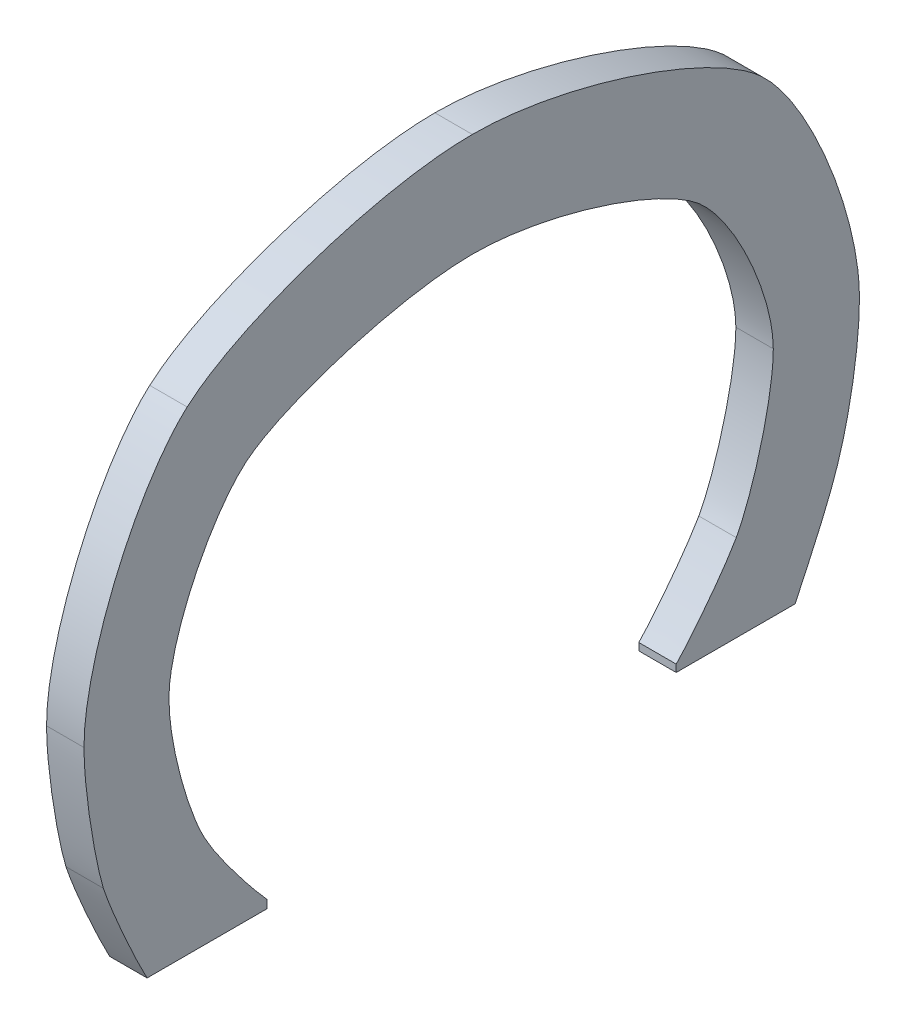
ISO-10303-21;
HEADER;
FILE_DESCRIPTION(('STEP AP214'),'2;1');
FILE_NAME('part.step','',(''),(''),'','','');
FILE_SCHEMA(('AUTOMOTIVE_DESIGN { 1 0 10303 214 1 1 1 1 }'));
ENDSEC;
DATA;
#1=APPLICATION_CONTEXT('core data for automotive mechanical design processes');
#2=APPLICATION_PROTOCOL_DEFINITION('international standard','automotive_design',2000,#1);
#3=PRODUCT_CONTEXT('',#1,'mechanical');
#4=PRODUCT('Part','Part','',(#3));
#5=PRODUCT_RELATED_PRODUCT_CATEGORY('part','',(#4));
#6=PRODUCT_DEFINITION_FORMATION('','',#4);
#7=PRODUCT_DEFINITION_CONTEXT('part definition',#1,'design');
#8=PRODUCT_DEFINITION('design','',#6,#7);
#9=PRODUCT_DEFINITION_SHAPE('','',#8);
#10=(LENGTH_UNIT() NAMED_UNIT(*) SI_UNIT(.MILLI.,.METRE.));
#11=(NAMED_UNIT(*) PLANE_ANGLE_UNIT() SI_UNIT($,.RADIAN.));
#12=(NAMED_UNIT(*) SI_UNIT($,.STERADIAN.) SOLID_ANGLE_UNIT());
#13=UNCERTAINTY_MEASURE_WITH_UNIT(LENGTH_MEASURE(1.E-05),#10,'distance_accuracy_value','');
#14=(GEOMETRIC_REPRESENTATION_CONTEXT(3) GLOBAL_UNCERTAINTY_ASSIGNED_CONTEXT((#13)) GLOBAL_UNIT_ASSIGNED_CONTEXT((#10,
#11,#12)) REPRESENTATION_CONTEXT('',''));
#15=CARTESIAN_POINT('',(0.,0.,0.));
#16=DIRECTION('',(0.,0.,1.));
#17=DIRECTION('',(1.,0.,0.));
#18=AXIS2_PLACEMENT_3D('',#15,#16,#17);
#19=CARTESIAN_POINT('',(-14.1348633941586,1.58473913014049,0.));
#20=DIRECTION('',(1.,0.,0.));
#21=DIRECTION('',(0.,0.,-1.));
#22=AXIS2_PLACEMENT_3D('',#19,#20,#21);
#23=PLANE('',#22);
#24=CARTESIAN_POINT('',(-14.1348633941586,4.6998806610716,-4.58456112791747));
#25=CARTESIAN_POINT('',(-14.1348633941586,4.69143462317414,-4.58456993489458));
#26=CARTESIAN_POINT('',(-14.1348633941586,4.68299504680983,-4.58483988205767));
#27=CARTESIAN_POINT('',(-14.1348633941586,4.66614586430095,-4.58580261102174));
#28=CARTESIAN_POINT('',(-14.1348633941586,4.65773623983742,-4.58649506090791));
#29=CARTESIAN_POINT('',(-14.1348633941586,4.63258663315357,-4.5890550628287));
#30=CARTESIAN_POINT('',(-14.1348633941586,4.61589701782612,-4.59140597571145));
#31=CARTESIAN_POINT('',(-14.1348633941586,4.58266715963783,-4.59702673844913));
#32=CARTESIAN_POINT('',(-14.1348633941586,4.56612704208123,-4.60029729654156));
#33=CARTESIAN_POINT('',(-14.1348633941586,4.53320637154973,-4.6075881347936));
#34=CARTESIAN_POINT('',(-14.1348633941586,4.51682588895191,-4.6116087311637));
#35=CARTESIAN_POINT('',(-14.1348633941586,4.48569399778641,-4.61994367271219));
#36=CARTESIAN_POINT('',(-14.1348633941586,4.47092706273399,-4.62420025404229));
#37=CARTESIAN_POINT('',(-14.1348633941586,4.44158135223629,-4.63328928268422));
#38=CARTESIAN_POINT('',(-14.1348633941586,4.42700246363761,-4.63812136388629));
#39=CARTESIAN_POINT('',(-14.1348633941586,4.39792962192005,-4.64850780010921));
#40=CARTESIAN_POINT('',(-14.1348633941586,4.38343810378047,-4.6540691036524));
#41=CARTESIAN_POINT('',(-14.1348633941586,4.36199771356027,-4.66313910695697));
#42=CARTESIAN_POINT('',(-14.1348633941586,4.35489745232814,-4.66628527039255));
#43=CARTESIAN_POINT('',(-14.1348633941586,4.34086111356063,-4.67293712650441));
#44=CARTESIAN_POINT('',(-14.1348633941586,4.33392518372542,-4.67644312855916));
#45=CARTESIAN_POINT('',(-14.1348633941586,4.32710918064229,-4.68018511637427));
#46=B_SPLINE_CURVE_WITH_KNOTS('',3,(#24,#25,#26,#27,#28,#29,#30,#31,#32,#33,#34,#35,#36,#37,#38,
#39,#40,#41,#42,#43,#44,#45),.UNSPECIFIED.,.F.,.F.,(4,2,2,2,2,2,2,2,2,2,4),(0.,
0.0253249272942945,0.0506299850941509,0.101153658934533,0.151716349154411,0.202300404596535,
0.248393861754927,0.294458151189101,0.340998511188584,0.364288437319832,0.387598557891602),.UNSPECIFIED.);
#47=CARTESIAN_POINT('',(-14.1348633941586,4.6998806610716,-4.58456112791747));
#48=VERTEX_POINT('',#47);
#49=CARTESIAN_POINT('',(-14.1348633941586,4.32710918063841,-4.68018511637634));
#50=VERTEX_POINT('',#49);
#51=EDGE_CURVE('E250',#48,#50,#46,.T.);
#52=ORIENTED_EDGE('',*,*,#51,.T.);
#53=CARTESIAN_POINT('',(-14.1348633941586,4.32710918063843,-4.68018511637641));
#54=CARTESIAN_POINT('',(-14.1348633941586,4.31978655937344,-4.68423254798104));
#55=CARTESIAN_POINT('',(-14.1348633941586,4.31256429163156,-4.68845294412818));
#56=CARTESIAN_POINT('',(-14.1348633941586,4.2982831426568,-4.69715546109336));
#57=CARTESIAN_POINT('',(-14.1348633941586,4.29122418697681,-4.70163745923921));
#58=CARTESIAN_POINT('',(-14.1348633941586,4.270237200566,-4.71534849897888));
#59=CARTESIAN_POINT('',(-14.1348633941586,4.25648779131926,-4.72484913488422));
#60=CARTESIAN_POINT('',(-14.1348633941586,4.2306924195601,-4.74333042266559));
#61=CARTESIAN_POINT('',(-14.1348633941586,4.21861444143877,-4.75226697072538));
#62=CARTESIAN_POINT('',(-14.1348633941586,4.1946759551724,-4.77043441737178));
#63=CARTESIAN_POINT('',(-14.1348633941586,4.18281551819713,-4.77966540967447));
#64=CARTESIAN_POINT('',(-14.1348633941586,4.15926809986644,-4.79841102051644));
#65=CARTESIAN_POINT('',(-14.1348633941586,4.14758168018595,-4.8079263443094));
#66=CARTESIAN_POINT('',(-14.1348633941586,4.1302322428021,-4.82240891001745));
#67=CARTESIAN_POINT('',(-14.1348633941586,4.12448075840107,-4.82726993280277));
#68=CARTESIAN_POINT('',(-14.1348633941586,4.11307269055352,-4.83710289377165));
#69=CARTESIAN_POINT('',(-14.1348633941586,4.10741611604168,-4.84207484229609));
#70=CARTESIAN_POINT('',(-14.1348633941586,4.10182554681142,-4.84712190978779));
#71=B_SPLINE_CURVE_WITH_KNOTS('',3,(#53,#54,#55,#56,#57,#58,#59,#60,#61,#62,#63,#64,#65,#66,#67,
#68,#69,#70),.UNSPECIFIED.,.F.,.F.,(4,2,2,2,2,2,2,2,4),(0.,0.0250917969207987,
0.0501719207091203,0.100293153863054,0.14536268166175,0.190446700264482,0.235653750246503,
0.258244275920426,0.280836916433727),.UNSPECIFIED.);
#72=CARTESIAN_POINT('',(-14.1348633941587,4.10182554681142,-4.84712190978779));
#73=VERTEX_POINT('',#72);
#74=EDGE_CURVE('E244',#50,#73,#71,.T.);
#75=ORIENTED_EDGE('',*,*,#74,.T.);
#76=DIRECTION('',(0.,1.,0.));
#77=VECTOR('',#76,1.);
#78=CARTESIAN_POINT('',(-14.1348633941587,4.10182554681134,-4.84712190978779));
#79=LINE('',#78,#77);
#80=CARTESIAN_POINT('',(-14.1348633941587,4.08075585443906,-4.84712190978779));
#81=VERTEX_POINT('',#80);
#82=EDGE_CURVE('E607',#73,#81,#79,.F.);
#83=ORIENTED_EDGE('',*,*,#82,.T.);
#84=DIRECTION('',(0.,0.,1.));
#85=VECTOR('',#84,1.);
#86=CARTESIAN_POINT('',(-14.1348633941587,4.08075585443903,-4.84712190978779));
#87=LINE('',#86,#85);
#88=CARTESIAN_POINT('',(-14.1348633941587,4.08075585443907,-4.52621428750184));
#89=VERTEX_POINT('',#88);
#90=EDGE_CURVE('E603',#81,#89,#87,.T.);
#91=ORIENTED_EDGE('',*,*,#90,.T.);
#92=CARTESIAN_POINT('',(-14.1348633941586,4.08075585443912,-4.52621428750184));
#93=CARTESIAN_POINT('',(-14.1348633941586,4.08811059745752,-4.52228095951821));
#94=CARTESIAN_POINT('',(-14.1348633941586,4.095513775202,-4.51844088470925));
#95=CARTESIAN_POINT('',(-14.1348633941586,4.11039002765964,-4.51090030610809));
#96=CARTESIAN_POINT('',(-14.1348633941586,4.11786309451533,-4.50719978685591));
#97=CARTESIAN_POINT('',(-14.1348633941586,4.14035209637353,-4.49623446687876));
#98=CARTESIAN_POINT('',(-14.1348633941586,4.15543492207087,-4.48910741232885));
#99=CARTESIAN_POINT('',(-14.1348633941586,4.18497440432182,-4.475470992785));
#100=CARTESIAN_POINT('',(-14.1348633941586,4.19942503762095,-4.46894852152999));
#101=CARTESIAN_POINT('',(-14.1348633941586,4.22843073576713,-4.4561437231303));
#102=CARTESIAN_POINT('',(-14.1348633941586,4.24298579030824,-4.44986137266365));
#103=CARTESIAN_POINT('',(-14.1348633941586,4.27224873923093,-4.43757294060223));
#104=CARTESIAN_POINT('',(-14.1348633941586,4.28695688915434,-4.43156746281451));
#105=CARTESIAN_POINT('',(-14.1348633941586,4.30915788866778,-4.4229074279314));
#106=CARTESIAN_POINT('',(-14.1348633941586,4.31658197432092,-4.42007855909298));
#107=CARTESIAN_POINT('',(-14.1348633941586,4.33150628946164,-4.41462451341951));
#108=CARTESIAN_POINT('',(-14.1348633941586,4.33900653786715,-4.41199938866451));
#109=CARTESIAN_POINT('',(-14.1348633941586,4.34655812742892,-4.40952060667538));
#110=B_SPLINE_CURVE_WITH_KNOTS('',3,(#92,#93,#94,#95,#96,#97,#98,#99,#100,#101,#102,#103,#104,
#105,#106,#107,#108,#109),.UNSPECIFIED.,.F.,.F.,(4,2,2,2,2,2,2,2,4),(0.,0.0250188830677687,
0.0500349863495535,0.100077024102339,0.147638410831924,0.195195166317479,0.242851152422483,
0.266683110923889,0.290521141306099),.UNSPECIFIED.);
#111=CARTESIAN_POINT('',(-14.1348633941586,4.34655812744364,-4.40952060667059));
#112=VERTEX_POINT('',#111);
#113=EDGE_CURVE('E237',#89,#112,#110,.T.);
#114=ORIENTED_EDGE('',*,*,#113,.T.);
#115=CARTESIAN_POINT('',(-14.1348633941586,4.34655812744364,-4.40952060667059));
#116=CARTESIAN_POINT('',(-14.1348633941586,4.35456573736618,-4.4071139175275));
#117=CARTESIAN_POINT('',(-14.1348633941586,4.36262679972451,-4.40490232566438));
#118=CARTESIAN_POINT('',(-14.1348633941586,4.37881800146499,-4.40075986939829));
#119=CARTESIAN_POINT('',(-14.1348633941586,4.38694811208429,-4.39882889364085));
#120=CARTESIAN_POINT('',(-14.1348633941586,4.41139237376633,-4.39329083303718));
#121=CARTESIAN_POINT('',(-14.1348633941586,4.42776301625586,-4.38993792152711));
#122=CARTESIAN_POINT('',(-14.1348633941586,4.46055622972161,-4.38369927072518));
#123=CARTESIAN_POINT('',(-14.1348633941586,4.47697862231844,-4.38081257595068));
#124=CARTESIAN_POINT('',(-14.1348633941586,4.50989127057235,-4.3754408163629));
#125=CARTESIAN_POINT('',(-14.1348633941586,4.52638153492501,-4.37295580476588));
#126=CARTESIAN_POINT('',(-14.1348633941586,4.55578004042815,-4.36890448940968));
#127=CARTESIAN_POINT('',(-14.1348633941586,4.56867699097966,-4.36725640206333));
#128=CARTESIAN_POINT('',(-14.1348633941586,4.5945030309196,-4.36425507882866));
#129=CARTESIAN_POINT('',(-14.1348633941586,4.60743211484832,-4.36290179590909));
#130=CARTESIAN_POINT('',(-14.1348633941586,4.6333238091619,-4.36055385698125));
#131=CARTESIAN_POINT('',(-14.1348633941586,4.64628641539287,-4.35955915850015));
#132=CARTESIAN_POINT('',(-14.1348633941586,4.67224865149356,-4.35813326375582));
#133=CARTESIAN_POINT('',(-14.1348633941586,4.68524829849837,-4.35770239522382));
#134=CARTESIAN_POINT('',(-14.1348633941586,4.69825991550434,-4.35765674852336));
#135=B_SPLINE_CURVE_WITH_KNOTS('',3,(#115,#116,#117,#118,#119,#120,#121,#122,#123,#124,#125,
#126,#127,#128,#129,#130,#131,#132,#133,#134),.UNSPECIFIED.,.F.,.F.,(4,2,2,2,2,2,2,2,2,4),(0.,
0.025074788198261,0.0501395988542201,0.10026126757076,0.150278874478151,0.200303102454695,
0.239305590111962,0.278301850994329,0.317293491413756,0.356307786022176),.UNSPECIFIED.);
#136=CARTESIAN_POINT('',(-14.1348633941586,4.6982599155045,-4.35765674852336));
#137=VERTEX_POINT('',#136);
#138=EDGE_CURVE('E230',#112,#137,#135,.T.);
#139=ORIENTED_EDGE('',*,*,#138,.T.);
#140=CARTESIAN_POINT('',(-14.1348633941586,4.6982599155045,-4.35765674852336));
#141=CARTESIAN_POINT('',(-14.1348633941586,4.71513153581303,-4.35770123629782));
#142=CARTESIAN_POINT('',(-14.1348633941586,4.73196546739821,-4.35862804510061));
#143=CARTESIAN_POINT('',(-14.1348633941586,4.7654669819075,-4.36187239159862));
#144=CARTESIAN_POINT('',(-14.1348633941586,4.7821348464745,-4.36418690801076));
#145=CARTESIAN_POINT('',(-14.1348633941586,4.81513818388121,-4.36981081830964));
#146=CARTESIAN_POINT('',(-14.1348633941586,4.83147529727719,-4.37311109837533));
#147=CARTESIAN_POINT('',(-14.1348633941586,4.86396881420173,-4.38054200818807));
#148=CARTESIAN_POINT('',(-14.1348633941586,4.88012509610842,-4.38467316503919));
#149=CARTESIAN_POINT('',(-14.1348633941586,4.92799508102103,-4.39803297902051));
#150=CARTESIAN_POINT('',(-14.1348633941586,4.95942404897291,-4.40828691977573));
#151=CARTESIAN_POINT('',(-14.1348633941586,5.02161075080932,-4.43113360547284));
#152=CARTESIAN_POINT('',(-14.1348633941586,5.05236375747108,-4.44373908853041));
#153=CARTESIAN_POINT('',(-14.1348633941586,5.10238366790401,-4.46643560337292));
#154=CARTESIAN_POINT('',(-14.1348633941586,5.12194233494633,-4.47588704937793));
#155=CARTESIAN_POINT('',(-14.1348633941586,5.16053353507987,-4.49580630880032));
#156=CARTESIAN_POINT('',(-14.1348633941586,5.17956619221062,-4.50627387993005));
#157=CARTESIAN_POINT('',(-14.1348633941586,5.21683189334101,-4.52829247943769));
#158=CARTESIAN_POINT('',(-14.1348633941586,5.23506930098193,-4.53983608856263));
#159=CARTESIAN_POINT('',(-14.1348633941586,5.27057803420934,-4.56430963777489));
#160=CARTESIAN_POINT('',(-14.1348633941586,5.28785068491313,-4.57723760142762));
#161=CARTESIAN_POINT('',(-14.1348633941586,5.31207654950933,-4.5976283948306));
#162=CARTESIAN_POINT('',(-14.1348633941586,5.31964526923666,-4.60435431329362));
#163=CARTESIAN_POINT('',(-14.1348633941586,5.33431091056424,-4.61834384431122));
#164=CARTESIAN_POINT('',(-14.1348633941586,5.3414062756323,-4.62560907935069));
#165=CARTESIAN_POINT('',(-14.1348633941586,5.3481788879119,-4.63318349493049));
#166=B_SPLINE_CURVE_WITH_KNOTS('',3,(#140,#141,#142,#143,#144,#145,#146,#147,#148,#149,#150,
#151,#152,#153,#154,#155,#156,#157,#158,#159,#160,#161,#162,#163,#164,#165),.UNSPECIFIED.,.F.,
.F.,(4,2,2,2,2,2,2,2,2,2,2,2,4),(0.,0.0505411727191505,0.100972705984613,0.150951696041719,
0.200962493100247,0.300028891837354,0.399648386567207,0.464791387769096,0.529918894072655,
0.594626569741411,0.659243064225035,0.689597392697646,0.720047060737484),.UNSPECIFIED.);
#167=CARTESIAN_POINT('',(-14.1348633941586,5.3481788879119,-4.63318349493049));
#168=VERTEX_POINT('',#167);
#169=EDGE_CURVE('E223',#137,#168,#166,.T.);
#170=ORIENTED_EDGE('',*,*,#169,.T.);
#171=CARTESIAN_POINT('',(-14.1348633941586,5.3481788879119,-4.63318349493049));
#172=CARTESIAN_POINT('',(-14.1348633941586,5.35312011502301,-4.63879258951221));
#173=CARTESIAN_POINT('',(-14.1348633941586,5.35788029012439,-4.64455393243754));
#174=CARTESIAN_POINT('',(-14.1348633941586,5.36709037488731,-4.65631243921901));
#175=CARTESIAN_POINT('',(-14.1348633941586,5.37154054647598,-4.66230939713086));
#176=CARTESIAN_POINT('',(-14.1348633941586,5.38449370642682,-4.68053460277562));
#177=CARTESIAN_POINT('',(-14.1348633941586,5.39262400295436,-4.69302648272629));
#178=CARTESIAN_POINT('',(-14.1348633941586,5.40811070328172,-4.71841027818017));
#179=CARTESIAN_POINT('',(-14.1348633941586,5.41546981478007,-4.73130057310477));
#180=CARTESIAN_POINT('',(-14.1348633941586,5.42960094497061,-4.75741158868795));
#181=CARTESIAN_POINT('',(-14.1348633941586,5.4363724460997,-4.77063258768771));
#182=CARTESIAN_POINT('',(-14.1348633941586,5.45271082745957,-4.8040536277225));
#183=CARTESIAN_POINT('',(-14.1348633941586,5.46196306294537,-4.82440733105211));
#184=CARTESIAN_POINT('',(-14.1348633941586,5.47952905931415,-4.86551739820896));
#185=CARTESIAN_POINT('',(-14.1348633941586,5.48784253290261,-4.88627388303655));
#186=CARTESIAN_POINT('',(-14.1348633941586,5.5115909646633,-4.94916778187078));
#187=CARTESIAN_POINT('',(-14.1348633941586,5.52576696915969,-4.9917876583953));
#188=CARTESIAN_POINT('',(-14.1348633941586,5.54693583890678,-5.0642701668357));
#189=CARTESIAN_POINT('',(-14.1348633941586,5.55478067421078,-5.09388965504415));
#190=CARTESIAN_POINT('',(-14.1348633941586,5.56884561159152,-5.15350022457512));
#191=CARTESIAN_POINT('',(-14.1348633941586,5.57506657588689,-5.18349109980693));
#192=CARTESIAN_POINT('',(-14.1348633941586,5.58555349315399,-5.24356184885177));
#193=CARTESIAN_POINT('',(-14.1348633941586,5.58983565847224,-5.27363878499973));
#194=CARTESIAN_POINT('',(-14.1348633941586,5.59441086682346,-5.31897006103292));
#195=CARTESIAN_POINT('',(-14.1348633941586,5.59562819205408,-5.33413028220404));
#196=CARTESIAN_POINT('',(-14.1348633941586,5.59730506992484,-5.3645018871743));
#197=CARTESIAN_POINT('',(-14.1348633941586,5.59776410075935,-5.37971329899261));
#198=CARTESIAN_POINT('',(-14.1348633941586,5.59777370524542,-5.39493391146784));
#199=B_SPLINE_CURVE_WITH_KNOTS('',3,(#171,#172,#173,#174,#175,#176,#177,#178,#179,#180,#181,
#182,#183,#184,#185,#186,#187,#188,#189,#190,#191,#192,#193,#194,#195,#196,#197,#198),
.UNSPECIFIED.,.F.,.F.,(4,2,2,2,2,2,2,2,2,2,2,2,2,4),(0.,0.0224135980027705,0.0448080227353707,
0.0894823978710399,0.133994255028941,0.178544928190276,0.245587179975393,0.312649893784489,
0.447244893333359,0.539132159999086,0.630970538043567,0.722026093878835,0.767636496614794,
0.813278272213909),.UNSPECIFIED.);
#200=CARTESIAN_POINT('',(-14.1348633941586,5.59777370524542,-5.39493391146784));
#201=VERTEX_POINT('',#200);
#202=EDGE_CURVE('E216',#168,#201,#199,.T.);
#203=ORIENTED_EDGE('',*,*,#202,.T.);
#204=CARTESIAN_POINT('',(-14.1348633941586,5.59777370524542,-5.39493391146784));
#205=CARTESIAN_POINT('',(-14.1348633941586,5.59775767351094,-5.41171817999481));
#206=CARTESIAN_POINT('',(-14.1348633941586,5.59719740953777,-5.42848973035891));
#207=CARTESIAN_POINT('',(-14.1348633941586,5.59517677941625,-5.46196372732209));
#208=CARTESIAN_POINT('',(-14.1348633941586,5.59371729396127,-5.47866622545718));
#209=CARTESIAN_POINT('',(-14.1348633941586,5.58826472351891,-5.52870312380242));
#210=CARTESIAN_POINT('',(-14.1348633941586,5.58319867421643,-5.56191729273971));
#211=CARTESIAN_POINT('',(-14.1348633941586,5.56785893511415,-5.64467480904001));
#212=CARTESIAN_POINT('',(-14.1348633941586,5.55624722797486,-5.6939673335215));
#213=CARTESIAN_POINT('',(-14.1348633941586,5.53591661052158,-5.76705164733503));
#214=CARTESIAN_POINT('',(-14.1348633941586,5.52865607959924,-5.79126562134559));
#215=CARTESIAN_POINT('',(-14.1348633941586,5.51314531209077,-5.83939492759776));
#216=CARTESIAN_POINT('',(-14.1348633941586,5.50489446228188,-5.86331006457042));
#217=CARTESIAN_POINT('',(-14.1348633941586,5.48692563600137,-5.91190040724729));
#218=CARTESIAN_POINT('',(-14.1348633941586,5.47715605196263,-5.93655654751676));
#219=CARTESIAN_POINT('',(-14.1348633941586,5.45630440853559,-5.9852724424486));
#220=CARTESIAN_POINT('',(-14.1348633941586,5.44522445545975,-6.00933308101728));
#221=CARTESIAN_POINT('',(-14.1348633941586,5.42729608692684,-6.04479625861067));
#222=CARTESIAN_POINT('',(-14.1348633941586,5.42109425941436,-6.05652538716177));
#223=CARTESIAN_POINT('',(-14.1348633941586,5.40816546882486,-6.07967985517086));
#224=CARTESIAN_POINT('',(-14.1348633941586,5.40143894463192,-6.09110543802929));
#225=CARTESIAN_POINT('',(-14.1348633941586,5.38727830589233,-6.113599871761));
#226=CARTESIAN_POINT('',(-14.1348633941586,5.37984074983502,-6.12466660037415));
#227=CARTESIAN_POINT('',(-14.1348633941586,5.36798184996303,-6.14077504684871));
#228=CARTESIAN_POINT('',(-14.1348633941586,5.36390577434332,-6.14606944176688));
#229=CARTESIAN_POINT('',(-14.1348633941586,5.3554629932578,-6.15642895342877));
#230=CARTESIAN_POINT('',(-14.1348633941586,5.35109600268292,-6.16149383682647));
#231=CARTESIAN_POINT('',(-14.1348633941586,5.3465581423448,-6.1664088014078));
#232=B_SPLINE_CURVE_WITH_KNOTS('',3,(#204,#205,#206,#207,#208,#209,#210,#211,#212,#213,#214,
#215,#216,#217,#218,#219,#220,#221,#222,#223,#224,#225,#226,#227,#228,#229,#230,#231),
.UNSPECIFIED.,.F.,.F.,(4,2,2,2,2,2,2,2,2,2,2,2,2,4),(0.,0.0503260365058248,0.100602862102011,
0.201304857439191,0.353016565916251,0.428840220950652,0.504711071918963,0.584245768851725,
0.663654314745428,0.70344723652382,0.743207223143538,0.783170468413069,0.803206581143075,
0.823262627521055),.UNSPECIFIED.);
#233=CARTESIAN_POINT('',(-14.1348633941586,5.3465581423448,-6.1664088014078));
#234=VERTEX_POINT('',#233);
#235=EDGE_CURVE('E209',#201,#234,#232,.T.);
#236=ORIENTED_EDGE('',*,*,#235,.T.);
#237=CARTESIAN_POINT('',(-14.1348633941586,5.3465581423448,-6.1664088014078));
#238=CARTESIAN_POINT('',(-14.1348633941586,5.33760954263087,-6.17614018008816));
#239=CARTESIAN_POINT('',(-14.1348633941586,5.32812541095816,-6.185330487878));
#240=CARTESIAN_POINT('',(-14.1348633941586,5.30839952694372,-6.20280691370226));
#241=CARTESIAN_POINT('',(-14.1348633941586,5.29816001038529,-6.21109553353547));
#242=CARTESIAN_POINT('',(-14.1348633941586,5.27722887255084,-6.22696456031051));
#243=CARTESIAN_POINT('',(-14.1348633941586,5.26653944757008,-6.23454793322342));
#244=CARTESIAN_POINT('',(-14.1348633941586,5.24477713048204,-6.24916292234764));
#245=CARTESIAN_POINT('',(-14.1348633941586,5.23370389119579,-6.2561940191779));
#246=CARTESIAN_POINT('',(-14.1348633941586,5.19299077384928,-6.28086665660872));
#247=CARTESIAN_POINT('',(-14.1348633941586,5.16250910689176,-6.29712135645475));
#248=CARTESIAN_POINT('',(-14.1348633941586,5.10022951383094,-6.32716804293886));
#249=CARTESIAN_POINT('',(-14.1348633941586,5.06842664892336,-6.34094952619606));
#250=CARTESIAN_POINT('',(-14.1348633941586,5.00939696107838,-6.36396940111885));
#251=CARTESIAN_POINT('',(-14.1348633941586,4.98231551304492,-6.37358173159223));
#252=CARTESIAN_POINT('',(-14.1348633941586,4.92760405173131,-6.39103146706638));
#253=CARTESIAN_POINT('',(-14.1348633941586,4.89997455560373,-6.39887046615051));
#254=CARTESIAN_POINT('',(-14.1348633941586,4.85826187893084,-6.40897376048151));
#255=CARTESIAN_POINT('',(-14.1348633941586,4.8443754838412,-6.41205553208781));
#256=CARTESIAN_POINT('',(-14.1348633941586,4.81648348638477,-6.41758857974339));
#257=CARTESIAN_POINT('',(-14.1348633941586,4.80247794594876,-6.4200401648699));
#258=CARTESIAN_POINT('',(-14.1348633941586,4.7743044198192,-6.42419208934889));
#259=CARTESIAN_POINT('',(-14.1348633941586,4.76013605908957,-6.42589001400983));
#260=CARTESIAN_POINT('',(-14.1348633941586,4.73169365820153,-6.42826440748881));
#261=CARTESIAN_POINT('',(-14.1348633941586,4.71741948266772,-6.42893919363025));
#262=CARTESIAN_POINT('',(-14.1348633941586,4.70312215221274,-6.42896958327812));
#263=B_SPLINE_CURVE_WITH_KNOTS('',3,(#237,#238,#239,#240,#241,#242,#243,#244,#245,#246,#247,
#248,#249,#250,#251,#252,#253,#254,#255,#256,#257,#258,#259,#260,#261,#262),.UNSPECIFIED.,.F.,
.F.,(4,2,2,2,2,2,2,2,2,2,2,2,4),(0.,0.0395878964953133,0.0790629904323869,0.118363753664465,
0.157701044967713,0.261161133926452,0.365050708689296,0.451209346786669,0.537290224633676,
0.579951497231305,0.622591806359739,0.665367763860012,0.70821399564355),.UNSPECIFIED.);
#264=CARTESIAN_POINT('',(-14.1348633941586,4.70312215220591,-6.42896958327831));
#265=VERTEX_POINT('',#264);
#266=EDGE_CURVE('E165',#234,#265,#263,.T.);
#267=ORIENTED_EDGE('',*,*,#266,.T.);
#268=CARTESIAN_POINT('',(-14.1348633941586,4.7031221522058,-6.42896958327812));
#269=CARTESIAN_POINT('',(-14.1348633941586,4.68641181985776,-6.42894644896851));
#270=CARTESIAN_POINT('',(-14.1348633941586,4.66971285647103,-6.42840593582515));
#271=CARTESIAN_POINT('',(-14.1348633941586,4.63637111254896,-6.42647096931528));
#272=CARTESIAN_POINT('',(-14.1348633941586,4.61972830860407,-6.42507693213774));
#273=CARTESIAN_POINT('',(-14.1348633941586,4.58653137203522,-6.42161696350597));
#274=CARTESIAN_POINT('',(-14.1348633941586,4.56997717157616,-6.41955165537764));
#275=CARTESIAN_POINT('',(-14.1348633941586,4.53694927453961,-6.4148235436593));
#276=CARTESIAN_POINT('',(-14.1348633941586,4.52047560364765,-6.41216056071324));
#277=CARTESIAN_POINT('',(-14.1348633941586,4.49073947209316,-6.40682752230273));
#278=CARTESIAN_POINT('',(-14.1348633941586,4.47745954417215,-6.4042542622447));
#279=CARTESIAN_POINT('',(-14.1348633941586,4.45098075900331,-6.39872461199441));
#280=CARTESIAN_POINT('',(-14.1348633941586,4.43778189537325,-6.39576825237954));
#281=CARTESIAN_POINT('',(-14.1348633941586,4.4114874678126,-6.38944119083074));
#282=CARTESIAN_POINT('',(-14.1348633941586,4.39839186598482,-6.38607064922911));
#283=CARTESIAN_POINT('',(-14.1348633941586,4.37234895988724,-6.37878607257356));
#284=CARTESIAN_POINT('',(-14.1348633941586,4.35940170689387,-6.3748718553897));
#285=CARTESIAN_POINT('',(-14.1348633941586,4.34655812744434,-6.37062274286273));
#286=B_SPLINE_CURVE_WITH_KNOTS('',3,(#268,#269,#270,#271,#272,#273,#274,#275,#276,#277,#278,
#279,#280,#281,#282,#283,#284,#285),.UNSPECIFIED.,.F.,.F.,(4,2,2,2,2,2,2,2,4),(0.,
0.0501076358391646,0.100190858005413,0.150227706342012,0.20027959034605,0.240855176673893,
0.281427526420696,0.321984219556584,0.362554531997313),.UNSPECIFIED.);
#287=CARTESIAN_POINT('',(-14.1348633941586,4.34655812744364,-6.37062274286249));
#288=VERTEX_POINT('',#287);
#289=EDGE_CURVE('E164',#265,#288,#286,.T.);
#290=ORIENTED_EDGE('',*,*,#289,.T.);
#291=CARTESIAN_POINT('',(-14.1348633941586,4.34655812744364,-6.37062274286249));
#292=CARTESIAN_POINT('',(-14.1348633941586,4.33858723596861,-6.36811384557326));
#293=CARTESIAN_POINT('',(-14.1348633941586,4.3306674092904,-6.3654517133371));
#294=CARTESIAN_POINT('',(-14.1348633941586,4.31491262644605,-6.35989381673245));
#295=CARTESIAN_POINT('',(-14.1348633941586,4.30707764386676,-6.35699812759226));
#296=CARTESIAN_POINT('',(-14.1348633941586,4.28367975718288,-6.34807238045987));
#297=CARTESIAN_POINT('',(-14.1348633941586,4.2682104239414,-6.34179913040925));
#298=CARTESIAN_POINT('',(-14.1348633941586,4.23831056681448,-6.32922974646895));
#299=CARTESIAN_POINT('',(-14.1348633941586,4.22387087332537,-6.3229550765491));
#300=CARTESIAN_POINT('',(-14.1348633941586,4.19508867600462,-6.31017449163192));
#301=CARTESIAN_POINT('',(-14.1348633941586,4.18074620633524,-6.30366849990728));
#302=CARTESIAN_POINT('',(-14.1348633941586,4.15212094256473,-6.29050520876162));
#303=CARTESIAN_POINT('',(-14.1348633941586,4.13783818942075,-6.28384782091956));
#304=CARTESIAN_POINT('',(-14.1348633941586,4.10929518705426,-6.27050352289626));
#305=CARTESIAN_POINT('',(-14.1348633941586,4.09503493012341,-6.26381662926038));
#306=CARTESIAN_POINT('',(-14.1348633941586,4.08075585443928,-6.25717055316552));
#307=B_SPLINE_CURVE_WITH_KNOTS('',3,(#291,#292,#293,#294,#295,#296,#297,#298,#299,#300,#301,
#302,#303,#304,#305,#306),.UNSPECIFIED.,.F.,.F.,(4,2,2,2,2,2,2,4),(0.,0.0250637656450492,
0.0501194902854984,0.100188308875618,0.147418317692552,0.194664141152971,0.24193830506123,
0.289188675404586),.UNSPECIFIED.);
#308=CARTESIAN_POINT('',(-14.1348633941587,4.08075585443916,-6.25717055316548));
#309=VERTEX_POINT('',#308);
#310=EDGE_CURVE('E24',#288,#309,#307,.T.);
#311=ORIENTED_EDGE('',*,*,#310,.T.);
#312=DIRECTION('',(0.,0.,1.));
#313=VECTOR('',#312,1.);
#314=CARTESIAN_POINT('',(-14.1348633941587,4.08075585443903,-6.25717055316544));
#315=LINE('',#314,#313);
#316=CARTESIAN_POINT('',(-14.1348633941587,4.08075585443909,-5.93950442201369));
#317=VERTEX_POINT('',#316);
#318=EDGE_CURVE('E639',#309,#317,#315,.T.);
#319=ORIENTED_EDGE('',*,*,#318,.T.);
#320=DIRECTION('',(0.,1.,0.));
#321=VECTOR('',#320,1.);
#322=CARTESIAN_POINT('',(-14.1348633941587,4.08075585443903,-5.93950442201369));
#323=LINE('',#322,#321);
#324=CARTESIAN_POINT('',(-14.1348633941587,4.10020480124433,-5.93950442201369));
#325=VERTEX_POINT('',#324);
#326=EDGE_CURVE('E635',#317,#325,#323,.T.);
#327=ORIENTED_EDGE('',*,*,#326,.T.);
#328=CARTESIAN_POINT('',(-14.1348633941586,4.10020480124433,-5.93950442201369));
#329=CARTESIAN_POINT('',(-14.1348633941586,4.10317736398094,-5.94244932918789));
#330=CARTESIAN_POINT('',(-14.1348633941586,4.10621088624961,-5.94532979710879));
#331=CARTESIAN_POINT('',(-14.1348633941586,4.11235874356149,-5.95100187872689));
#332=CARTESIAN_POINT('',(-14.1348633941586,4.11547305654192,-5.95379351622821));
#333=CARTESIAN_POINT('',(-14.1348633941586,4.12487584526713,-5.96209557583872));
#334=CARTESIAN_POINT('',(-14.1348633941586,4.13122629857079,-5.96753514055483));
#335=CARTESIAN_POINT('',(-14.1348633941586,4.14403011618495,-5.97829468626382));
#336=CARTESIAN_POINT('',(-14.1348633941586,4.1504835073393,-5.98361463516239));
#337=CARTESIAN_POINT('',(-14.1348633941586,4.1634701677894,-5.9941574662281));
#338=CARTESIAN_POINT('',(-14.1348633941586,4.17000344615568,-5.99938033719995));
#339=CARTESIAN_POINT('',(-14.1348633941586,4.18742887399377,-6.01311747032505));
#340=CARTESIAN_POINT('',(-14.1348633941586,4.19838211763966,-6.02155443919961));
#341=CARTESIAN_POINT('',(-14.1348633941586,4.2204799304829,-6.03817033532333));
#342=CARTESIAN_POINT('',(-14.1348633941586,4.23162446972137,-6.04634930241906));
#343=CARTESIAN_POINT('',(-14.1348633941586,4.25418555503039,-6.06241696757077));
#344=CARTESIAN_POINT('',(-14.1348633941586,4.26560295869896,-6.07030447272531));
#345=CARTESIAN_POINT('',(-14.1348633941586,4.2829722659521,-6.08177229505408));
#346=CARTESIAN_POINT('',(-14.1348633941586,4.2888033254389,-6.08553478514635));
#347=CARTESIAN_POINT('',(-14.1348633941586,4.30057465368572,-6.09288825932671));
#348=CARTESIAN_POINT('',(-14.1348633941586,4.30651495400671,-6.09647919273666));
#349=CARTESIAN_POINT('',(-14.1348633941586,4.31252247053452,-6.09995823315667));
#350=B_SPLINE_CURVE_WITH_KNOTS('',3,(#328,#329,#330,#331,#332,#333,#334,#335,#336,#337,#338,
#339,#340,#341,#342,#343,#344,#345,#346,#347,#348,#349),.UNSPECIFIED.,.F.,.F.,(4,2,2,2,2,2,2,2,
2,2,4),(0.,0.0125491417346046,0.0250948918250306,0.0501776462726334,0.0752670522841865,
0.100359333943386,0.141833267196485,0.183300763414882,0.224922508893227,0.24573867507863,
0.26656095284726),.UNSPECIFIED.);
#351=CARTESIAN_POINT('',(-14.1348633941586,4.31252247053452,-6.09995823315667));
#352=VERTEX_POINT('',#351);
#353=EDGE_CURVE('E281',#325,#352,#350,.T.);
#354=ORIENTED_EDGE('',*,*,#353,.T.);
#355=CARTESIAN_POINT('',(-14.1348633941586,4.31252247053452,-6.09995823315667));
#356=CARTESIAN_POINT('',(-14.1348633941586,4.31960537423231,-6.10383326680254));
#357=CARTESIAN_POINT('',(-14.1348633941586,4.32682409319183,-6.10743760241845));
#358=CARTESIAN_POINT('',(-14.1348633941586,4.34144081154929,-6.11424472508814));
#359=CARTESIAN_POINT('',(-14.1348633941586,4.34883861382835,-6.11744793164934));
#360=CARTESIAN_POINT('',(-14.1348633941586,4.36373580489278,-6.12359994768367));
#361=CARTESIAN_POINT('',(-14.1348633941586,4.37123518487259,-6.12654877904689));
#362=CARTESIAN_POINT('',(-14.1348633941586,4.38631496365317,-6.13223982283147));
#363=CARTESIAN_POINT('',(-14.1348633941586,4.39389539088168,-6.13498195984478));
#364=CARTESIAN_POINT('',(-14.1348633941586,4.42530260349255,-6.14595211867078));
#365=CARTESIAN_POINT('',(-14.1348633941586,4.44938798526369,-6.15344184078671));
#366=CARTESIAN_POINT('',(-14.1348633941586,4.49793993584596,-6.16710486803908));
#367=CARTESIAN_POINT('',(-14.1348633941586,4.52240670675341,-6.17327744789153));
#368=CARTESIAN_POINT('',(-14.1348633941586,4.55961299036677,-6.18146522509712));
#369=CARTESIAN_POINT('',(-14.1348633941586,4.57223028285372,-6.18403641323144));
#370=CARTESIAN_POINT('',(-14.1348633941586,4.59754585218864,-6.188711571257));
#371=CARTESIAN_POINT('',(-14.1348633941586,4.61024408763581,-6.19081576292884));
#372=CARTESIAN_POINT('',(-14.1348633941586,4.63571518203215,-6.19443213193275));
#373=CARTESIAN_POINT('',(-14.1348633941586,4.64848795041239,-6.19594491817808));
#374=CARTESIAN_POINT('',(-14.1348633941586,4.66771156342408,-6.19758784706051));
#375=CARTESIAN_POINT('',(-14.1348633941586,4.67413499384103,-6.19803121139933));
#376=CARTESIAN_POINT('',(-14.1348633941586,4.68699803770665,-6.19864666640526));
#377=CARTESIAN_POINT('',(-14.1348633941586,4.69343765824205,-6.19881860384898));
#378=CARTESIAN_POINT('',(-14.1348633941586,4.69988066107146,-6.19882371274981));
#379=B_SPLINE_CURVE_WITH_KNOTS('',3,(#355,#356,#357,#358,#359,#360,#361,#362,#363,#364,#365,
#366,#367,#368,#369,#370,#371,#372,#373,#374,#375,#376,#377,#378),.UNSPECIFIED.,.F.,.F.,(4,2,2,
2,2,2,2,2,2,2,2,4),(0.,0.0241999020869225,0.0483742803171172,0.0725465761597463,
0.096727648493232,0.17234575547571,0.248005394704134,0.286628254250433,0.325232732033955,
0.36379735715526,0.383108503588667,0.402430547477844),.UNSPECIFIED.);
#380=CARTESIAN_POINT('',(-14.1348633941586,4.6998806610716,-6.19882371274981));
#381=VERTEX_POINT('',#380);
#382=EDGE_CURVE('E276',#352,#381,#379,.T.);
#383=ORIENTED_EDGE('',*,*,#382,.T.);
#384=CARTESIAN_POINT('',(-14.1348633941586,4.6998806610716,-6.19882371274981));
#385=CARTESIAN_POINT('',(-14.1348633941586,4.71126273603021,-6.19877220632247));
#386=CARTESIAN_POINT('',(-14.1348633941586,4.72260472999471,-6.19801933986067));
#387=CARTESIAN_POINT('',(-14.1348633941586,4.74513850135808,-6.19545296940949));
#388=CARTESIAN_POINT('',(-14.1348633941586,4.75633062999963,-6.19364268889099));
#389=CARTESIAN_POINT('',(-14.1348633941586,4.7785425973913,-6.18930335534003));
#390=CARTESIAN_POINT('',(-14.1348633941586,4.78956272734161,-6.18677569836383));
#391=CARTESIAN_POINT('',(-14.1348633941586,4.8114631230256,-6.18113713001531));
#392=CARTESIAN_POINT('',(-14.1348633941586,4.82234324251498,-6.17802565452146));
#393=CARTESIAN_POINT('',(-14.1348633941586,4.85627713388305,-6.16750241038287));
#394=CARTESIAN_POINT('',(-14.1348633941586,4.87906590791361,-6.15923267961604));
#395=CARTESIAN_POINT('',(-14.1348633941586,4.92394867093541,-6.14091534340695));
#396=CARTESIAN_POINT('',(-14.1348633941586,4.94604157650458,-6.13086511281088));
#397=CARTESIAN_POINT('',(-14.1348633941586,4.98318092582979,-6.11213005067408));
#398=CARTESIAN_POINT('',(-14.1348633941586,4.99844284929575,-6.10387104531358));
#399=CARTESIAN_POINT('',(-14.1348633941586,5.02838163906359,-6.08638249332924));
#400=CARTESIAN_POINT('',(-14.1348633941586,5.0430592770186,-6.07715428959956));
#401=CARTESIAN_POINT('',(-14.1348633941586,5.06445943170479,-6.0624338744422));
#402=CARTESIAN_POINT('',(-14.1348633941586,5.07148648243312,-6.05738367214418));
#403=CARTESIAN_POINT('',(-14.1348633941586,5.08527990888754,-6.04694616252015));
#404=CARTESIAN_POINT('',(-14.1348633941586,5.09204644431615,-6.04155906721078));
#405=CARTESIAN_POINT('',(-14.1348633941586,5.10527998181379,-6.03036159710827));
#406=CARTESIAN_POINT('',(-14.1348633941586,5.11174544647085,-6.02454937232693));
#407=CARTESIAN_POINT('',(-14.1348633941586,5.1242023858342,-6.01241533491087));
#408=CARTESIAN_POINT('',(-14.1348633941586,5.13019282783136,-6.00609246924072));
#409=CARTESIAN_POINT('',(-14.1348633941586,5.13586121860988,-5.9994720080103));
#410=B_SPLINE_CURVE_WITH_KNOTS('',3,(#384,#385,#386,#387,#388,#389,#390,#391,#392,#393,#394,
#395,#396,#397,#398,#399,#400,#401,#402,#403,#404,#405,#406,#407,#408,#409),.UNSPECIFIED.,.F.,
.F.,(4,2,2,2,2,2,2,2,2,2,2,2,4),(0.,0.0340721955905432,0.0680410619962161,0.101944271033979,
0.135880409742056,0.208512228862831,0.281252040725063,0.333283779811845,0.385244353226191,
0.411196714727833,0.43713290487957,0.463189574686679,0.489301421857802),.UNSPECIFIED.);
#411=CARTESIAN_POINT('',(-14.1348633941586,5.1358612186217,-5.99947200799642));
#412=VERTEX_POINT('',#411);
#413=EDGE_CURVE('E270',#381,#412,#410,.T.);
#414=ORIENTED_EDGE('',*,*,#413,.T.);
#415=CARTESIAN_POINT('',(-14.1348633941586,5.1358612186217,-5.99947200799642));
#416=CARTESIAN_POINT('',(-14.1348633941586,5.13985784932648,-5.99470671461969));
#417=CARTESIAN_POINT('',(-14.1348633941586,5.14367376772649,-5.98979888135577));
#418=CARTESIAN_POINT('',(-14.1348633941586,5.15100777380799,-5.97977309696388));
#419=CARTESIAN_POINT('',(-14.1348633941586,5.15452620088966,-5.97465539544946));
#420=CARTESIAN_POINT('',(-14.1348633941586,5.16472426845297,-5.95911189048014));
#421=CARTESIAN_POINT('',(-14.1348633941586,5.17106849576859,-5.94846799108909));
#422=CARTESIAN_POINT('',(-14.1348633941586,5.18310100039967,-5.92687921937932));
#423=CARTESIAN_POINT('',(-14.1348633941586,5.18879180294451,-5.91593572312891));
#424=CARTESIAN_POINT('',(-14.1348633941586,5.19968905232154,-5.89379928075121));
#425=CARTESIAN_POINT('',(-14.1348633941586,5.20489504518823,-5.88260611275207));
#426=CARTESIAN_POINT('',(-14.1348633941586,5.22164199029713,-5.84486708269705));
#427=CARTESIAN_POINT('',(-14.1348633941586,5.23228482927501,-5.81792222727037));
#428=CARTESIAN_POINT('',(-14.1348633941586,5.25190184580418,-5.76335025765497));
#429=CARTESIAN_POINT('',(-14.1348633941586,5.26087068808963,-5.73572126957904));
#430=CARTESIAN_POINT('',(-14.1348633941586,5.27652490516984,-5.68232074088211));
#431=CARTESIAN_POINT('',(-14.1348633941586,5.28333844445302,-5.65658683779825));
#432=CARTESIAN_POINT('',(-14.1348633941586,5.29554348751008,-5.60479427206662));
#433=CARTESIAN_POINT('',(-14.1348633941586,5.3009355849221,-5.57873574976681));
#434=CARTESIAN_POINT('',(-14.1348633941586,5.31002712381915,-5.52652441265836));
#435=CARTESIAN_POINT('',(-14.1348633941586,5.31373952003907,-5.50037394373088));
#436=CARTESIAN_POINT('',(-14.1348633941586,5.31770760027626,-5.46096433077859));
#437=CARTESIAN_POINT('',(-14.1348633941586,5.3187637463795,-5.44778639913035));
#438=CARTESIAN_POINT('',(-14.1348633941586,5.32021900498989,-5.42138631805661));
#439=CARTESIAN_POINT('',(-14.1348633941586,5.32061767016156,-5.40816414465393));
#440=CARTESIAN_POINT('',(-14.1348633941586,5.32062621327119,-5.39493391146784));
#441=B_SPLINE_CURVE_WITH_KNOTS('',3,(#415,#416,#417,#418,#419,#420,#421,#422,#423,#424,#425,
#426,#427,#428,#429,#430,#431,#432,#433,#434,#435,#436,#437,#438,#439,#440),.UNSPECIFIED.,.F.,
.F.,(4,2,2,2,2,2,2,2,2,2,2,2,4),(0.,0.018643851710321,0.0372661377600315,0.0744054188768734,
0.111395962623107,0.148420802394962,0.235248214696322,0.322347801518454,0.402171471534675,
0.481961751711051,0.561125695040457,0.600771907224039,0.640445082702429),.UNSPECIFIED.);
#442=CARTESIAN_POINT('',(-14.1348633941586,5.32062621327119,-5.39493391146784));
#443=VERTEX_POINT('',#442);
#444=EDGE_CURVE('E263',#412,#443,#441,.T.);
#445=ORIENTED_EDGE('',*,*,#444,.T.);
#446=CARTESIAN_POINT('',(-14.1348633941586,5.32062621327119,-5.39493391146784));
#447=CARTESIAN_POINT('',(-14.1348633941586,5.32059142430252,-5.3781227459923));
#448=CARTESIAN_POINT('',(-14.1348633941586,5.3199173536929,-5.36133144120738));
#449=CARTESIAN_POINT('',(-14.1348633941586,5.31755416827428,-5.3278379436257));
#450=CARTESIAN_POINT('',(-14.1348633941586,5.31586626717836,-5.31113566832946));
#451=CARTESIAN_POINT('',(-14.1348633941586,5.31173277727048,-5.27779037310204));
#452=CARTESIAN_POINT('',(-14.1348633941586,5.30928542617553,-5.26114758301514));
#453=CARTESIAN_POINT('',(-14.1348633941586,5.30375196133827,-5.22796284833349));
#454=CARTESIAN_POINT('',(-14.1348633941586,5.30066558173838,-5.21142094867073));
#455=CARTESIAN_POINT('',(-14.1348633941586,5.29016224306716,-5.15991432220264));
#456=CARTESIAN_POINT('',(-14.1348633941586,5.28177714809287,-5.1251422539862));
#457=CARTESIAN_POINT('',(-14.1348633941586,5.26753614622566,-5.07348204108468));
#458=CARTESIAN_POINT('',(-14.1348633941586,5.26251581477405,-5.05635619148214));
#459=CARTESIAN_POINT('',(-14.1348633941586,5.25188967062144,-5.02227463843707));
#460=CARTESIAN_POINT('',(-14.1348633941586,5.24628353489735,-5.00531903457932));
#461=CARTESIAN_POINT('',(-14.1348633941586,5.23423109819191,-4.97105990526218));
#462=CARTESIAN_POINT('',(-14.1348633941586,5.22776272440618,-4.95376412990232));
#463=CARTESIAN_POINT('',(-14.1348633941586,5.21402100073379,-4.91951587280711));
#464=CARTESIAN_POINT('',(-14.1348633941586,5.20674873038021,-4.90256296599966));
#465=CARTESIAN_POINT('',(-14.1348633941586,5.19501488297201,-4.87748511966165));
#466=CARTESIAN_POINT('',(-14.1348633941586,5.1909586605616,-4.8691710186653));
#467=CARTESIAN_POINT('',(-14.1348633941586,5.18250959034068,-4.85272256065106));
#468=CARTESIAN_POINT('',(-14.1348633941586,5.17811697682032,-4.84458808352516));
#469=CARTESIAN_POINT('',(-14.1348633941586,5.16888585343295,-4.82852230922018));
#470=CARTESIAN_POINT('',(-14.1348633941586,5.16404551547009,-4.82059203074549));
#471=CARTESIAN_POINT('',(-14.1348633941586,5.15372435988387,-4.80513714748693));
#472=CARTESIAN_POINT('',(-14.1348633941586,5.1482420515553,-4.79761354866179));
#473=CARTESIAN_POINT('',(-14.1348633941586,5.1423442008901,-4.79039581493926));
#474=B_SPLINE_CURVE_WITH_KNOTS('',3,(#446,#447,#448,#449,#450,#451,#452,#453,#454,#455,#456,
#457,#458,#459,#460,#461,#462,#463,#464,#465,#466,#467,#468,#469,#470,#471,#472,#473),
.UNSPECIFIED.,.F.,.F.,(4,2,2,2,2,2,2,2,2,2,2,2,2,4),(0.,0.05039472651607,0.100729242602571,
0.151181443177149,0.201654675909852,0.308863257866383,0.362396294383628,0.415959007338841,
0.471341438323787,0.526650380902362,0.554396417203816,0.582123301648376,0.609968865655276,
0.637880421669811),.UNSPECIFIED.);
#475=CARTESIAN_POINT('',(-14.1348633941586,5.1423442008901,-4.79039581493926));
#476=VERTEX_POINT('',#475);
#477=EDGE_CURVE('E256',#443,#476,#474,.T.);
#478=ORIENTED_EDGE('',*,*,#477,.T.);
#479=CARTESIAN_POINT('',(-14.1348633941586,5.1423442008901,-4.79039581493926));
#480=CARTESIAN_POINT('',(-14.1348633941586,5.13482065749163,-4.78166534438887));
#481=CARTESIAN_POINT('',(-14.1348633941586,5.12679004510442,-4.77341868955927));
#482=CARTESIAN_POINT('',(-14.1348633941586,5.11001441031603,-4.75773272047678));
#483=CARTESIAN_POINT('',(-14.1348633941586,5.10127160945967,-4.75029105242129));
#484=CARTESIAN_POINT('',(-14.1348633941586,5.08334319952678,-4.73602072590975));
#485=CARTESIAN_POINT('',(-14.1348633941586,5.07415864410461,-4.7291907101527));
#486=CARTESIAN_POINT('',(-14.1348633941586,5.05542893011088,-4.71602660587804));
#487=CARTESIAN_POINT('',(-14.1348633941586,5.0458834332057,-4.70969300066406));
#488=CARTESIAN_POINT('',(-14.1348633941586,5.01538876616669,-4.69042700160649));
#489=CARTESIAN_POINT('',(-14.1348633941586,4.99394358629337,-4.67827788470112));
#490=CARTESIAN_POINT('',(-14.1348633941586,4.95013409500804,-4.65568946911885));
#491=CARTESIAN_POINT('',(-14.1348633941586,4.92776827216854,-4.64525313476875));
#492=CARTESIAN_POINT('',(-14.1348633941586,4.88867090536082,-4.62886577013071));
#493=CARTESIAN_POINT('',(-14.1348633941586,4.87212156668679,-4.62247831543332));
#494=CARTESIAN_POINT('',(-14.1348633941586,4.83866248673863,-4.61078322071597));
#495=CARTESIAN_POINT('',(-14.1348633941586,4.82175326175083,-4.60547413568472));
#496=CARTESIAN_POINT('',(-14.1348633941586,4.79612365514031,-4.59855382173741));
#497=CARTESIAN_POINT('',(-14.1348633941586,4.78754339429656,-4.59642227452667));
#498=CARTESIAN_POINT('',(-14.1348633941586,4.77029428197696,-4.59257920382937));
#499=CARTESIAN_POINT('',(-14.1348633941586,4.76162549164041,-4.59086740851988));
#500=CARTESIAN_POINT('',(-14.1348633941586,4.7441569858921,-4.58795279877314));
#501=CARTESIAN_POINT('',(-14.1348633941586,4.73535685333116,-4.58675234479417));
#502=CARTESIAN_POINT('',(-14.1348633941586,4.71767140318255,-4.58506731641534));
#503=CARTESIAN_POINT('',(-14.1348633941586,4.70878594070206,-4.58458432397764));
#504=CARTESIAN_POINT('',(-14.1348633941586,4.6998806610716,-4.58456112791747));
#505=B_SPLINE_CURVE_WITH_KNOTS('',3,(#479,#480,#481,#482,#483,#484,#485,#486,#487,#488,#489,
#490,#491,#492,#493,#494,#495,#496,#497,#498,#499,#500,#501,#502,#503,#504),.UNSPECIFIED.,.F.,
.F.,(4,2,2,2,2,2,2,2,2,2,2,2,4),(0.,0.0345028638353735,0.0689019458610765,0.103222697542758,
0.13757645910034,0.211418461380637,0.285386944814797,0.338576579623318,0.391694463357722,
0.418209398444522,0.444707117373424,0.471325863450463,0.498003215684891),.UNSPECIFIED.);
#506=EDGE_CURVE('E198',#476,#48,#505,.T.);
#507=ORIENTED_EDGE('',*,*,#506,.T.);
#508=EDGE_LOOP('',(#52,#75,#83,#91,#114,#139,#170,#203,#236,#267,#290,#311,#319,#327,#354,#383,
#414,#445,#478,#507));
#509=FACE_BOUND('',#508,.T.);
#510=ADVANCED_FACE('F17',(#509),#23,.F.);
#511=CARTESIAN_POINT('',(-14.1348633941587,4.34655812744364,-6.37062274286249));
#512=CARTESIAN_POINT('',(-14.0348633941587,4.34655812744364,-6.37062274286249));
#513=CARTESIAN_POINT('',(-14.1348633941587,4.2639001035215,-6.34469081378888));
#514=CARTESIAN_POINT('',(-14.0348633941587,4.2639001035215,-6.34469081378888));
#515=CARTESIAN_POINT('',(-14.1348633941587,4.14720642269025,-6.28796471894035));
#516=CARTESIAN_POINT('',(-14.0348633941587,4.14720642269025,-6.28796471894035));
#517=CARTESIAN_POINT('',(-14.1348633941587,4.08075585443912,-6.25717055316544));
#518=CARTESIAN_POINT('',(-14.0348633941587,4.08075585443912,-6.25717055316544));
#519=B_SPLINE_SURFACE_WITH_KNOTS('',3,1,((#511,#512),(#513,#514),(#515,#516),(#517,#518)),
.UNSPECIFIED.,.F.,.F.,.F.,(4,4),(2,2),(0.,1.),(0.,0.01),.UNSPECIFIED.);
#520=DIRECTION('',(1.,0.,0.));
#521=VECTOR('',#520,1.);
#522=CARTESIAN_POINT('',(-14.0848633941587,4.34655812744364,-6.37062274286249));
#523=LINE('',#522,#521);
#524=CARTESIAN_POINT('',(-14.0348633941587,4.34655812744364,-6.37062274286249));
#525=VERTEX_POINT('',#524);
#526=EDGE_CURVE('E158',#288,#525,#523,.T.);
#527=CARTESIAN_POINT('',(-14.0348633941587,4.34655812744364,-6.37062274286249));
#528=CARTESIAN_POINT('',(-14.0348633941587,4.33858723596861,-6.36811384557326));
#529=CARTESIAN_POINT('',(-14.0348633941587,4.3306674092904,-6.3654517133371));
#530=CARTESIAN_POINT('',(-14.0348633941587,4.31491262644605,-6.35989381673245));
#531=CARTESIAN_POINT('',(-14.0348633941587,4.30707764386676,-6.35699812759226));
#532=CARTESIAN_POINT('',(-14.0348633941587,4.28367975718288,-6.34807238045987));
#533=CARTESIAN_POINT('',(-14.0348633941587,4.26821042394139,-6.34179913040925));
#534=CARTESIAN_POINT('',(-14.0348633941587,4.23831056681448,-6.32922974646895));
#535=CARTESIAN_POINT('',(-14.0348633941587,4.22387087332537,-6.3229550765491));
#536=CARTESIAN_POINT('',(-14.0348633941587,4.19508867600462,-6.31017449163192));
#537=CARTESIAN_POINT('',(-14.0348633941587,4.18074620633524,-6.30366849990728));
#538=CARTESIAN_POINT('',(-14.0348633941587,4.15212094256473,-6.29050520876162));
#539=CARTESIAN_POINT('',(-14.0348633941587,4.13783818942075,-6.28384782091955));
#540=CARTESIAN_POINT('',(-14.0348633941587,4.10929518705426,-6.27050352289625));
#541=CARTESIAN_POINT('',(-14.0348633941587,4.09503493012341,-6.26381662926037));
#542=CARTESIAN_POINT('',(-14.0348633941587,4.08075585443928,-6.25717055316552));
#543=B_SPLINE_CURVE_WITH_KNOTS('',3,(#527,#528,#529,#530,#531,#532,#533,#534,#535,#536,#537,
#538,#539,#540,#541,#542),.UNSPECIFIED.,.F.,.F.,(4,2,2,2,2,2,2,4),(0.,0.0250637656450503,
0.0501194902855,0.100188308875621,0.147418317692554,0.194664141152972,0.241938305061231,
0.289188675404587),.UNSPECIFIED.);
#544=CARTESIAN_POINT('',(-14.0348633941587,4.08075585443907,-6.25717055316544));
#545=VERTEX_POINT('',#544);
#546=EDGE_CURVE('E168',#525,#545,#543,.T.);
#547=DIRECTION('',(1.,0.,0.));
#548=VECTOR('',#547,1.);
#549=CARTESIAN_POINT('',(-39.7858458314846,4.08075585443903,-6.25717055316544));
#550=LINE('',#549,#548);
#551=EDGE_CURVE('E159',#545,#309,#550,.F.);
#552=ORIENTED_EDGE('',*,*,#526,.T.);
#553=ORIENTED_EDGE('',*,*,#546,.T.);
#554=ORIENTED_EDGE('',*,*,#551,.T.);
#555=ORIENTED_EDGE('',*,*,#310,.F.);
#556=EDGE_LOOP('',(#552,#553,#554,#555));
#557=FACE_BOUND('',#556,.T.);
#558=ADVANCED_FACE('F156',(#557),#519,.F.);
#559=CARTESIAN_POINT('',(-39.7858458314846,4.08075585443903,-6.25717055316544));
#560=DIRECTION('',(0.,1.,0.));
#561=DIRECTION('',(0.,0.,1.));
#562=AXIS2_PLACEMENT_3D('',#559,#560,#561);
#563=PLANE('',#562);
#564=ORIENTED_EDGE('',*,*,#551,.F.);
#565=DIRECTION('',(0.,0.,1.));
#566=VECTOR('',#565,1.);
#567=CARTESIAN_POINT('',(-14.0348633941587,4.08075585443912,-0.050000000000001));
#568=LINE('',#567,#566);
#569=CARTESIAN_POINT('',(-14.0348633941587,4.08075585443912,-5.93950442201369));
#570=VERTEX_POINT('',#569);
#571=EDGE_CURVE('E170',#545,#570,#568,.T.);
#572=ORIENTED_EDGE('',*,*,#571,.T.);
#573=DIRECTION('',(-1.,0.,0.));
#574=VECTOR('',#573,1.);
#575=CARTESIAN_POINT('',(-39.7858458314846,4.08075585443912,-5.93950442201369));
#576=LINE('',#575,#574);
#577=EDGE_CURVE('E636',#570,#317,#576,.T.);
#578=ORIENTED_EDGE('',*,*,#577,.T.);
#579=ORIENTED_EDGE('',*,*,#318,.F.);
#580=EDGE_LOOP('',(#564,#572,#578,#579));
#581=FACE_BOUND('',#580,.T.);
#582=ADVANCED_FACE('F189',(#581),#563,.F.);
#583=CARTESIAN_POINT('',(-39.7858458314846,4.08075585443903,-5.93950442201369));
#584=DIRECTION('',(0.,0.,-1.));
#585=DIRECTION('',(-1.,0.,0.));
#586=AXIS2_PLACEMENT_3D('',#583,#584,#585);
#587=PLANE('',#586);
#588=ORIENTED_EDGE('',*,*,#577,.F.);
#589=DIRECTION('',(0.,1.,0.));
#590=VECTOR('',#589,1.);
#591=CARTESIAN_POINT('',(-14.0348633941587,1.58473913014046,-5.93950442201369));
#592=LINE('',#591,#590);
#593=CARTESIAN_POINT('',(-14.0348633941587,4.10020480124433,-5.93950442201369));
#594=VERTEX_POINT('',#593);
#595=EDGE_CURVE('E311',#570,#594,#592,.T.);
#596=ORIENTED_EDGE('',*,*,#595,.T.);
#597=DIRECTION('',(-1.,0.,0.));
#598=VECTOR('',#597,1.);
#599=CARTESIAN_POINT('',(-14.0848633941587,4.10020480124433,-5.93950442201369));
#600=LINE('',#599,#598);
#601=EDGE_CURVE('E286',#594,#325,#600,.T.);
#602=ORIENTED_EDGE('',*,*,#601,.T.);
#603=ORIENTED_EDGE('',*,*,#326,.F.);
#604=EDGE_LOOP('',(#588,#596,#602,#603));
#605=FACE_BOUND('',#604,.T.);
#606=ADVANCED_FACE('F293',(#605),#587,.F.);
#607=CARTESIAN_POINT('',(-14.1348633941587,4.10020480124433,-5.93950442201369));
#608=CARTESIAN_POINT('',(-14.0348633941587,4.10020480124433,-5.93950442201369));
#609=CARTESIAN_POINT('',(-14.1348633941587,4.13099896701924,-5.97029858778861));
#610=CARTESIAN_POINT('',(-14.0348633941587,4.13099896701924,-5.97029858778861));
#611=CARTESIAN_POINT('',(-14.1348633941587,4.23958892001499,-6.05781884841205));
#612=CARTESIAN_POINT('',(-14.0348633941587,4.23958892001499,-6.05781884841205));
#613=CARTESIAN_POINT('',(-14.1348633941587,4.31252247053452,-6.09995823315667));
#614=CARTESIAN_POINT('',(-14.0348633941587,4.31252247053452,-6.09995823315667));
#615=B_SPLINE_SURFACE_WITH_KNOTS('',3,1,((#607,#608),(#609,#610),(#611,#612),(#613,#614)),
.UNSPECIFIED.,.F.,.F.,.F.,(4,4),(2,2),(0.,1.),(0.,0.010000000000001),.UNSPECIFIED.);
#616=CARTESIAN_POINT('',(-14.0348633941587,4.10020480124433,-5.93950442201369));
#617=CARTESIAN_POINT('',(-14.0348633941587,4.10317736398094,-5.94244932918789));
#618=CARTESIAN_POINT('',(-14.0348633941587,4.10621088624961,-5.94532979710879));
#619=CARTESIAN_POINT('',(-14.0348633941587,4.11235874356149,-5.95100187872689));
#620=CARTESIAN_POINT('',(-14.0348633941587,4.11547305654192,-5.95379351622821));
#621=CARTESIAN_POINT('',(-14.0348633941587,4.12487584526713,-5.96209557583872));
#622=CARTESIAN_POINT('',(-14.0348633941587,4.13122629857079,-5.96753514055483));
#623=CARTESIAN_POINT('',(-14.0348633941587,4.14403011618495,-5.97829468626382));
#624=CARTESIAN_POINT('',(-14.0348633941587,4.1504835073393,-5.98361463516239));
#625=CARTESIAN_POINT('',(-14.0348633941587,4.1634701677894,-5.9941574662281));
#626=CARTESIAN_POINT('',(-14.0348633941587,4.17000344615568,-5.99938033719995));
#627=CARTESIAN_POINT('',(-14.0348633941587,4.18742887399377,-6.01311747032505));
#628=CARTESIAN_POINT('',(-14.0348633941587,4.19838211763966,-6.02155443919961));
#629=CARTESIAN_POINT('',(-14.0348633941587,4.2204799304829,-6.03817033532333));
#630=CARTESIAN_POINT('',(-14.0348633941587,4.23162446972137,-6.04634930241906));
#631=CARTESIAN_POINT('',(-14.0348633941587,4.25418555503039,-6.06241696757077));
#632=CARTESIAN_POINT('',(-14.0348633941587,4.26560295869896,-6.07030447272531));
#633=CARTESIAN_POINT('',(-14.0348633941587,4.28297226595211,-6.08177229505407));
#634=CARTESIAN_POINT('',(-14.0348633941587,4.2888033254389,-6.08553478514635));
#635=CARTESIAN_POINT('',(-14.0348633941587,4.30057465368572,-6.09288825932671));
#636=CARTESIAN_POINT('',(-14.0348633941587,4.30651495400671,-6.09647919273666));
#637=CARTESIAN_POINT('',(-14.0348633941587,4.31252247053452,-6.09995823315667));
#638=B_SPLINE_CURVE_WITH_KNOTS('',3,(#616,#617,#618,#619,#620,#621,#622,#623,#624,#625,#626,
#627,#628,#629,#630,#631,#632,#633,#634,#635,#636,#637),.UNSPECIFIED.,.F.,.F.,(4,2,2,2,2,2,2,2,
2,2,4),(0.,0.0125491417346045,0.0250948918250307,0.0501776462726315,0.0752670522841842,
0.100359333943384,0.141833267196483,0.183300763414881,0.224922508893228,0.245738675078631,
0.26656095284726),.UNSPECIFIED.);
#639=CARTESIAN_POINT('',(-14.0348633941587,4.31252247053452,-6.09995823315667));
#640=VERTEX_POINT('',#639);
#641=EDGE_CURVE('E304',#594,#640,#638,.T.);
#642=DIRECTION('',(-1.,0.,0.));
#643=VECTOR('',#642,1.);
#644=CARTESIAN_POINT('',(-14.0848633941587,4.31252247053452,-6.09995823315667));
#645=LINE('',#644,#643);
#646=EDGE_CURVE('E285',#640,#352,#645,.T.);
#647=ORIENTED_EDGE('',*,*,#601,.F.);
#648=ORIENTED_EDGE('',*,*,#641,.T.);
#649=ORIENTED_EDGE('',*,*,#646,.T.);
#650=ORIENTED_EDGE('',*,*,#353,.F.);
#651=EDGE_LOOP('',(#647,#648,#649,#650));
#652=FACE_BOUND('',#651,.T.);
#653=ADVANCED_FACE('F287',(#652),#615,.F.);
#654=CARTESIAN_POINT('',(-14.1348633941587,4.31252247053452,-6.09995823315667));
#655=CARTESIAN_POINT('',(-14.0348633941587,4.31252247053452,-6.09995823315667));
#656=CARTESIAN_POINT('',(-14.1348633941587,4.38869751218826,-6.14209761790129));
#657=CARTESIAN_POINT('',(-14.0348633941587,4.38869751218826,-6.14209761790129));
#658=CARTESIAN_POINT('',(-14.1348633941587,4.58480772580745,-6.19882371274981));
#659=CARTESIAN_POINT('',(-14.0348633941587,4.58480772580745,-6.19882371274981));
#660=CARTESIAN_POINT('',(-14.1348633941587,4.6998806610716,-6.19882371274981));
#661=CARTESIAN_POINT('',(-14.0348633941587,4.6998806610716,-6.19882371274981));
#662=B_SPLINE_SURFACE_WITH_KNOTS('',3,1,((#654,#655),(#656,#657),(#658,#659),(#660,#661)),
.UNSPECIFIED.,.F.,.F.,.F.,(4,4),(2,2),(0.,1.),(0.,0.01),.UNSPECIFIED.);
#663=CARTESIAN_POINT('',(-14.0348633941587,4.31252247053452,-6.09995823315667));
#664=CARTESIAN_POINT('',(-14.0348633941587,4.31960537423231,-6.10383326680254));
#665=CARTESIAN_POINT('',(-14.0348633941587,4.32682409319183,-6.10743760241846));
#666=CARTESIAN_POINT('',(-14.0348633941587,4.34144081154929,-6.11424472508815));
#667=CARTESIAN_POINT('',(-14.0348633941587,4.34883861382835,-6.11744793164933));
#668=CARTESIAN_POINT('',(-14.0348633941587,4.36373580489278,-6.12359994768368));
#669=CARTESIAN_POINT('',(-14.0348633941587,4.37123518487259,-6.12654877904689));
#670=CARTESIAN_POINT('',(-14.0348633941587,4.38631496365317,-6.13223982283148));
#671=CARTESIAN_POINT('',(-14.0348633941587,4.39389539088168,-6.13498195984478));
#672=CARTESIAN_POINT('',(-14.0348633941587,4.42530260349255,-6.14595211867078));
#673=CARTESIAN_POINT('',(-14.0348633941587,4.44938798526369,-6.15344184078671));
#674=CARTESIAN_POINT('',(-14.0348633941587,4.49793993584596,-6.16710486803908));
#675=CARTESIAN_POINT('',(-14.0348633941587,4.52240670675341,-6.17327744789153));
#676=CARTESIAN_POINT('',(-14.0348633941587,4.55961299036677,-6.18146522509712));
#677=CARTESIAN_POINT('',(-14.0348633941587,4.57223028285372,-6.18403641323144));
#678=CARTESIAN_POINT('',(-14.0348633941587,4.59754585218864,-6.188711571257));
#679=CARTESIAN_POINT('',(-14.0348633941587,4.61024408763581,-6.19081576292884));
#680=CARTESIAN_POINT('',(-14.0348633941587,4.63571518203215,-6.19443213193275));
#681=CARTESIAN_POINT('',(-14.0348633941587,4.64848795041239,-6.19594491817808));
#682=CARTESIAN_POINT('',(-14.0348633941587,4.66771156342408,-6.19758784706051));
#683=CARTESIAN_POINT('',(-14.0348633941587,4.67413499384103,-6.19803121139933));
#684=CARTESIAN_POINT('',(-14.0348633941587,4.68699803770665,-6.19864666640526));
#685=CARTESIAN_POINT('',(-14.0348633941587,4.69343765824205,-6.19881860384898));
#686=CARTESIAN_POINT('',(-14.0348633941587,4.69988066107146,-6.19882371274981));
#687=B_SPLINE_CURVE_WITH_KNOTS('',3,(#663,#664,#665,#666,#667,#668,#669,#670,#671,#672,#673,
#674,#675,#676,#677,#678,#679,#680,#681,#682,#683,#684,#685,#686),.UNSPECIFIED.,.F.,.F.,(4,2,2,
2,2,2,2,2,2,2,2,4),(0.,0.0241999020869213,0.0483742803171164,0.0725465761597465,
0.0967276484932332,0.172345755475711,0.248005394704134,0.286628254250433,0.325232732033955,
0.36379735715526,0.383108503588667,0.402430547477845),.UNSPECIFIED.);
#688=CARTESIAN_POINT('',(-14.0348633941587,4.6998806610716,-6.19882371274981));
#689=VERTEX_POINT('',#688);
#690=EDGE_CURVE('E310',#640,#689,#687,.T.);
#691=DIRECTION('',(-1.,0.,0.));
#692=VECTOR('',#691,1.);
#693=CARTESIAN_POINT('',(-14.0848633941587,4.6998806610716,-6.19882371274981));
#694=LINE('',#693,#692);
#695=EDGE_CURVE('E628',#689,#381,#694,.T.);
#696=ORIENTED_EDGE('',*,*,#646,.F.);
#697=ORIENTED_EDGE('',*,*,#690,.T.);
#698=ORIENTED_EDGE('',*,*,#695,.T.);
#699=ORIENTED_EDGE('',*,*,#382,.F.);
#700=EDGE_LOOP('',(#696,#697,#698,#699));
#701=FACE_BOUND('',#700,.T.);
#702=ADVANCED_FACE('F292',(#701),#662,.F.);
#703=CARTESIAN_POINT('',(-14.1348633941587,4.6998806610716,-6.19882371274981));
#704=CARTESIAN_POINT('',(-14.0348633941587,4.6998806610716,-6.19882371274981));
#705=CARTESIAN_POINT('',(-14.1348633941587,4.82629881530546,-6.19882371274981));
#706=CARTESIAN_POINT('',(-14.0348633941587,4.82629881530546,-6.19882371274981));
#707=CARTESIAN_POINT('',(-14.1348633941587,5.05158244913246,-6.09833748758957));
#708=CARTESIAN_POINT('',(-14.0348633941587,5.05158244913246,-6.09833748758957));
#709=CARTESIAN_POINT('',(-14.1348633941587,5.1358612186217,-5.99947200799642));
#710=CARTESIAN_POINT('',(-14.0348633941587,5.1358612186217,-5.99947200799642));
#711=B_SPLINE_SURFACE_WITH_KNOTS('',3,1,((#703,#704),(#705,#706),(#707,#708),(#709,#710)),
.UNSPECIFIED.,.F.,.F.,.F.,(4,4),(2,2),(0.,1.),(0.,0.01),.UNSPECIFIED.);
#712=CARTESIAN_POINT('',(-14.0348633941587,4.6998806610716,-6.19882371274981));
#713=CARTESIAN_POINT('',(-14.0348633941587,4.71126273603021,-6.19877220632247));
#714=CARTESIAN_POINT('',(-14.0348633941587,4.72260472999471,-6.19801933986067));
#715=CARTESIAN_POINT('',(-14.0348633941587,4.74513850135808,-6.19545296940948));
#716=CARTESIAN_POINT('',(-14.0348633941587,4.75633062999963,-6.19364268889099));
#717=CARTESIAN_POINT('',(-14.0348633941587,4.7785425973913,-6.18930335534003));
#718=CARTESIAN_POINT('',(-14.0348633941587,4.78956272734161,-6.18677569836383));
#719=CARTESIAN_POINT('',(-14.0348633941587,4.8114631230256,-6.18113713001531));
#720=CARTESIAN_POINT('',(-14.0348633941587,4.82234324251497,-6.17802565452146));
#721=CARTESIAN_POINT('',(-14.0348633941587,4.85627713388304,-6.16750241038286));
#722=CARTESIAN_POINT('',(-14.0348633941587,4.8790659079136,-6.15923267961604));
#723=CARTESIAN_POINT('',(-14.0348633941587,4.92394867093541,-6.14091534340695));
#724=CARTESIAN_POINT('',(-14.0348633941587,4.94604157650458,-6.13086511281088));
#725=CARTESIAN_POINT('',(-14.0348633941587,4.98318092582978,-6.11213005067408));
#726=CARTESIAN_POINT('',(-14.0348633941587,4.99844284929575,-6.10387104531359));
#727=CARTESIAN_POINT('',(-14.0348633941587,5.02838163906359,-6.08638249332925));
#728=CARTESIAN_POINT('',(-14.0348633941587,5.0430592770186,-6.07715428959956));
#729=CARTESIAN_POINT('',(-14.0348633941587,5.06445943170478,-6.0624338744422));
#730=CARTESIAN_POINT('',(-14.0348633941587,5.07148648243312,-6.05738367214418));
#731=CARTESIAN_POINT('',(-14.0348633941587,5.08527990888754,-6.04694616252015));
#732=CARTESIAN_POINT('',(-14.0348633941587,5.09204644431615,-6.04155906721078));
#733=CARTESIAN_POINT('',(-14.0348633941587,5.10527998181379,-6.03036159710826));
#734=CARTESIAN_POINT('',(-14.0348633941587,5.11174544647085,-6.02454937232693));
#735=CARTESIAN_POINT('',(-14.0348633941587,5.1242023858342,-6.01241533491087));
#736=CARTESIAN_POINT('',(-14.0348633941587,5.13019282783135,-6.00609246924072));
#737=CARTESIAN_POINT('',(-14.0348633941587,5.13586121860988,-5.9994720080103));
#738=B_SPLINE_CURVE_WITH_KNOTS('',3,(#712,#713,#714,#715,#716,#717,#718,#719,#720,#721,#722,
#723,#724,#725,#726,#727,#728,#729,#730,#731,#732,#733,#734,#735,#736,#737),.UNSPECIFIED.,.F.,
.F.,(4,2,2,2,2,2,2,2,2,2,2,2,4),(0.,0.034072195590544,0.0680410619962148,0.101944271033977,
0.135880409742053,0.208512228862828,0.281252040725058,0.333283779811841,0.385244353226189,
0.411196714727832,0.437132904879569,0.463189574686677,0.489301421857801),.UNSPECIFIED.);
#739=CARTESIAN_POINT('',(-14.0348633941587,5.1358612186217,-5.99947200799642));
#740=VERTEX_POINT('',#739);
#741=EDGE_CURVE('E396',#689,#740,#738,.T.);
#742=DIRECTION('',(-1.,0.,0.));
#743=VECTOR('',#742,1.);
#744=CARTESIAN_POINT('',(-14.0848633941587,5.1358612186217,-5.99947200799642));
#745=LINE('',#744,#743);
#746=EDGE_CURVE('E625',#740,#412,#745,.T.);
#747=ORIENTED_EDGE('',*,*,#695,.F.);
#748=ORIENTED_EDGE('',*,*,#741,.T.);
#749=ORIENTED_EDGE('',*,*,#746,.T.);
#750=ORIENTED_EDGE('',*,*,#413,.F.);
#751=EDGE_LOOP('',(#747,#748,#749,#750));
#752=FACE_BOUND('',#751,.T.);
#753=ADVANCED_FACE('F401',(#752),#711,.F.);
#754=CARTESIAN_POINT('',(-14.1348633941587,5.1358612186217,-5.99947200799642));
#755=CARTESIAN_POINT('',(-14.0348633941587,5.1358612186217,-5.99947200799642));
#756=CARTESIAN_POINT('',(-14.1348633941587,5.22176073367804,-5.89736503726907));
#757=CARTESIAN_POINT('',(-14.0348633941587,5.22176073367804,-5.89736503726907));
#758=CARTESIAN_POINT('',(-14.1348633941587,5.32062621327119,-5.60076859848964));
#759=CARTESIAN_POINT('',(-14.0348633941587,5.32062621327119,-5.60076859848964));
#760=CARTESIAN_POINT('',(-14.1348633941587,5.32062621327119,-5.39493391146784));
#761=CARTESIAN_POINT('',(-14.0348633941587,5.32062621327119,-5.39493391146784));
#762=B_SPLINE_SURFACE_WITH_KNOTS('',3,1,((#754,#755),(#756,#757),(#758,#759),(#760,#761)),
.UNSPECIFIED.,.F.,.F.,.F.,(4,4),(2,2),(0.,1.),(0.,0.01),.UNSPECIFIED.);
#763=CARTESIAN_POINT('',(-14.0348633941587,5.1358612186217,-5.99947200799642));
#764=CARTESIAN_POINT('',(-14.0348633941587,5.13985784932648,-5.99470671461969));
#765=CARTESIAN_POINT('',(-14.0348633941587,5.14367376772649,-5.98979888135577));
#766=CARTESIAN_POINT('',(-14.0348633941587,5.15100777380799,-5.97977309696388));
#767=CARTESIAN_POINT('',(-14.0348633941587,5.15452620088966,-5.97465539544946));
#768=CARTESIAN_POINT('',(-14.0348633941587,5.16472426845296,-5.95911189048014));
#769=CARTESIAN_POINT('',(-14.0348633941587,5.17106849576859,-5.94846799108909));
#770=CARTESIAN_POINT('',(-14.0348633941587,5.18310100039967,-5.92687921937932));
#771=CARTESIAN_POINT('',(-14.0348633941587,5.1887918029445,-5.91593572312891));
#772=CARTESIAN_POINT('',(-14.0348633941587,5.19968905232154,-5.89379928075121));
#773=CARTESIAN_POINT('',(-14.0348633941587,5.20489504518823,-5.88260611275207));
#774=CARTESIAN_POINT('',(-14.0348633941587,5.22164199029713,-5.84486708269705));
#775=CARTESIAN_POINT('',(-14.0348633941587,5.23228482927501,-5.81792222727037));
#776=CARTESIAN_POINT('',(-14.0348633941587,5.25190184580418,-5.76335025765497));
#777=CARTESIAN_POINT('',(-14.0348633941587,5.26087068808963,-5.73572126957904));
#778=CARTESIAN_POINT('',(-14.0348633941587,5.27652490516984,-5.68232074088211));
#779=CARTESIAN_POINT('',(-14.0348633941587,5.28333844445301,-5.65658683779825));
#780=CARTESIAN_POINT('',(-14.0348633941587,5.29554348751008,-5.60479427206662));
#781=CARTESIAN_POINT('',(-14.0348633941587,5.3009355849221,-5.57873574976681));
#782=CARTESIAN_POINT('',(-14.0348633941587,5.31002712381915,-5.52652441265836));
#783=CARTESIAN_POINT('',(-14.0348633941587,5.31373952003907,-5.50037394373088));
#784=CARTESIAN_POINT('',(-14.0348633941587,5.31770760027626,-5.46096433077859));
#785=CARTESIAN_POINT('',(-14.0348633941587,5.3187637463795,-5.44778639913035));
#786=CARTESIAN_POINT('',(-14.0348633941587,5.32021900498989,-5.42138631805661));
#787=CARTESIAN_POINT('',(-14.0348633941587,5.32061767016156,-5.40816414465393));
#788=CARTESIAN_POINT('',(-14.0348633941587,5.32062621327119,-5.39493391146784));
#789=B_SPLINE_CURVE_WITH_KNOTS('',3,(#763,#764,#765,#766,#767,#768,#769,#770,#771,#772,#773,
#774,#775,#776,#777,#778,#779,#780,#781,#782,#783,#784,#785,#786,#787,#788),.UNSPECIFIED.,.F.,
.F.,(4,2,2,2,2,2,2,2,2,2,2,2,4),(0.,0.0186438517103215,0.0372661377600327,0.0744054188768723,
0.111395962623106,0.14842080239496,0.235248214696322,0.322347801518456,0.402171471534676,
0.481961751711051,0.561125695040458,0.600771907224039,0.64044508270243),.UNSPECIFIED.);
#790=CARTESIAN_POINT('',(-14.0348633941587,5.32062621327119,-5.39493391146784));
#791=VERTEX_POINT('',#790);
#792=EDGE_CURVE('E392',#740,#791,#789,.T.);
#793=DIRECTION('',(-1.,0.,0.));
#794=VECTOR('',#793,1.);
#795=CARTESIAN_POINT('',(-14.0848633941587,5.32062621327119,-5.39493391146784));
#796=LINE('',#795,#794);
#797=EDGE_CURVE('E622',#791,#443,#796,.T.);
#798=ORIENTED_EDGE('',*,*,#746,.F.);
#799=ORIENTED_EDGE('',*,*,#792,.T.);
#800=ORIENTED_EDGE('',*,*,#797,.T.);
#801=ORIENTED_EDGE('',*,*,#444,.F.);
#802=EDGE_LOOP('',(#798,#799,#800,#801));
#803=FACE_BOUND('',#802,.T.);
#804=ADVANCED_FACE('F406',(#803),#762,.F.);
#805=CARTESIAN_POINT('',(-14.1348633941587,5.32062621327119,-5.39493391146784));
#806=CARTESIAN_POINT('',(-14.0348633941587,5.32062621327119,-5.39493391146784));
#807=CARTESIAN_POINT('',(-14.1348633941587,5.32062621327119,-5.20206518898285));
#808=CARTESIAN_POINT('',(-14.0348633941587,5.32062621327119,-5.20206518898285));
#809=CARTESIAN_POINT('',(-14.1348633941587,5.22662297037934,-4.89250278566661));
#810=CARTESIAN_POINT('',(-14.0348633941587,5.22662297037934,-4.89250278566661));
#811=CARTESIAN_POINT('',(-14.1348633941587,5.1423442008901,-4.79039581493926));
#812=CARTESIAN_POINT('',(-14.0348633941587,5.1423442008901,-4.79039581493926));
#813=B_SPLINE_SURFACE_WITH_KNOTS('',3,1,((#805,#806),(#807,#808),(#809,#810),(#811,#812)),
.UNSPECIFIED.,.F.,.F.,.F.,(4,4),(2,2),(0.,1.),(0.,0.01),.UNSPECIFIED.);
#814=CARTESIAN_POINT('',(-14.0348633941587,5.32062621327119,-5.39493391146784));
#815=CARTESIAN_POINT('',(-14.0348633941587,5.32059142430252,-5.3781227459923));
#816=CARTESIAN_POINT('',(-14.0348633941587,5.3199173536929,-5.36133144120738));
#817=CARTESIAN_POINT('',(-14.0348633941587,5.31755416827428,-5.3278379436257));
#818=CARTESIAN_POINT('',(-14.0348633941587,5.31586626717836,-5.31113566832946));
#819=CARTESIAN_POINT('',(-14.0348633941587,5.31173277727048,-5.27779037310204));
#820=CARTESIAN_POINT('',(-14.0348633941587,5.30928542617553,-5.26114758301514));
#821=CARTESIAN_POINT('',(-14.0348633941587,5.30375196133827,-5.22796284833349));
#822=CARTESIAN_POINT('',(-14.0348633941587,5.30066558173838,-5.21142094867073));
#823=CARTESIAN_POINT('',(-14.0348633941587,5.29016224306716,-5.15991432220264));
#824=CARTESIAN_POINT('',(-14.0348633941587,5.28177714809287,-5.1251422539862));
#825=CARTESIAN_POINT('',(-14.0348633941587,5.26753614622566,-5.07348204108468));
#826=CARTESIAN_POINT('',(-14.0348633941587,5.26251581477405,-5.05635619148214));
#827=CARTESIAN_POINT('',(-14.0348633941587,5.25188967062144,-5.02227463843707));
#828=CARTESIAN_POINT('',(-14.0348633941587,5.24628353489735,-5.00531903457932));
#829=CARTESIAN_POINT('',(-14.0348633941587,5.23423109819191,-4.97105990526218));
#830=CARTESIAN_POINT('',(-14.0348633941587,5.22776272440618,-4.95376412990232));
#831=CARTESIAN_POINT('',(-14.0348633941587,5.21402100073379,-4.91951587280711));
#832=CARTESIAN_POINT('',(-14.0348633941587,5.20674873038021,-4.90256296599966));
#833=CARTESIAN_POINT('',(-14.0348633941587,5.19501488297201,-4.87748511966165));
#834=CARTESIAN_POINT('',(-14.0348633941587,5.1909586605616,-4.8691710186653));
#835=CARTESIAN_POINT('',(-14.0348633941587,5.18250959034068,-4.85272256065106));
#836=CARTESIAN_POINT('',(-14.0348633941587,5.17811697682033,-4.84458808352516));
#837=CARTESIAN_POINT('',(-14.0348633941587,5.16888585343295,-4.82852230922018));
#838=CARTESIAN_POINT('',(-14.0348633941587,5.16404551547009,-4.82059203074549));
#839=CARTESIAN_POINT('',(-14.0348633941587,5.15372435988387,-4.80513714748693));
#840=CARTESIAN_POINT('',(-14.0348633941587,5.1482420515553,-4.79761354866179));
#841=CARTESIAN_POINT('',(-14.0348633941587,5.1423442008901,-4.79039581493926));
#842=B_SPLINE_CURVE_WITH_KNOTS('',3,(#814,#815,#816,#817,#818,#819,#820,#821,#822,#823,#824,
#825,#826,#827,#828,#829,#830,#831,#832,#833,#834,#835,#836,#837,#838,#839,#840,#841),
.UNSPECIFIED.,.F.,.F.,(4,2,2,2,2,2,2,2,2,2,2,2,2,4),(0.,0.0503947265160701,0.100729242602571,
0.151181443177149,0.201654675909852,0.308863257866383,0.362396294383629,0.415959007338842,
0.471341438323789,0.526650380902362,0.554396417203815,0.582123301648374,0.609968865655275,
0.637880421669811),.UNSPECIFIED.);
#843=CARTESIAN_POINT('',(-14.0348633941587,5.1423442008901,-4.79039581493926));
#844=VERTEX_POINT('',#843);
#845=EDGE_CURVE('E386',#791,#844,#842,.T.);
#846=DIRECTION('',(-1.,0.,0.));
#847=VECTOR('',#846,1.);
#848=CARTESIAN_POINT('',(-14.0848633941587,5.1423442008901,-4.79039581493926));
#849=LINE('',#848,#847);
#850=EDGE_CURVE('E619',#844,#476,#849,.T.);
#851=ORIENTED_EDGE('',*,*,#797,.F.);
#852=ORIENTED_EDGE('',*,*,#845,.T.);
#853=ORIENTED_EDGE('',*,*,#850,.T.);
#854=ORIENTED_EDGE('',*,*,#477,.F.);
#855=EDGE_LOOP('',(#851,#852,#853,#854));
#856=FACE_BOUND('',#855,.T.);
#857=ADVANCED_FACE('F418',(#856),#813,.F.);
#858=CARTESIAN_POINT('',(-14.1348633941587,5.1423442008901,-4.79039581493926));
#859=CARTESIAN_POINT('',(-14.0348633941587,5.1423442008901,-4.79039581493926));
#860=CARTESIAN_POINT('',(-14.1348633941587,5.05644468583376,-4.68990958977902));
#861=CARTESIAN_POINT('',(-14.0348633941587,5.05644468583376,-4.68990958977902));
#862=CARTESIAN_POINT('',(-14.1348633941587,4.82791956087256,-4.58456112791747));
#863=CARTESIAN_POINT('',(-14.0348633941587,4.82791956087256,-4.58456112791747));
#864=CARTESIAN_POINT('',(-14.1348633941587,4.6998806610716,-4.58456112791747));
#865=CARTESIAN_POINT('',(-14.0348633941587,4.6998806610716,-4.58456112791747));
#866=B_SPLINE_SURFACE_WITH_KNOTS('',3,1,((#858,#859),(#860,#861),(#862,#863),(#864,#865)),
.UNSPECIFIED.,.F.,.F.,.F.,(4,4),(2,2),(0.,1.),(0.,0.01),.UNSPECIFIED.);
#867=CARTESIAN_POINT('',(-14.0348633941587,5.1423442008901,-4.79039581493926));
#868=CARTESIAN_POINT('',(-14.0348633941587,5.13482065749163,-4.78166534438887));
#869=CARTESIAN_POINT('',(-14.0348633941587,5.12679004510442,-4.77341868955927));
#870=CARTESIAN_POINT('',(-14.0348633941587,5.11001441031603,-4.75773272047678));
#871=CARTESIAN_POINT('',(-14.0348633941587,5.10127160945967,-4.75029105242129));
#872=CARTESIAN_POINT('',(-14.0348633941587,5.08334319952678,-4.73602072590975));
#873=CARTESIAN_POINT('',(-14.0348633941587,5.07415864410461,-4.7291907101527));
#874=CARTESIAN_POINT('',(-14.0348633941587,5.05542893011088,-4.71602660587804));
#875=CARTESIAN_POINT('',(-14.0348633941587,5.0458834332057,-4.70969300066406));
#876=CARTESIAN_POINT('',(-14.0348633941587,5.01538876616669,-4.69042700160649));
#877=CARTESIAN_POINT('',(-14.0348633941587,4.99394358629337,-4.67827788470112));
#878=CARTESIAN_POINT('',(-14.0348633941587,4.95013409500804,-4.65568946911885));
#879=CARTESIAN_POINT('',(-14.0348633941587,4.92776827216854,-4.64525313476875));
#880=CARTESIAN_POINT('',(-14.0348633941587,4.88867090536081,-4.62886577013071));
#881=CARTESIAN_POINT('',(-14.0348633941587,4.87212156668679,-4.62247831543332));
#882=CARTESIAN_POINT('',(-14.0348633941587,4.83866248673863,-4.61078322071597));
#883=CARTESIAN_POINT('',(-14.0348633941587,4.82175326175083,-4.60547413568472));
#884=CARTESIAN_POINT('',(-14.0348633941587,4.79612365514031,-4.59855382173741));
#885=CARTESIAN_POINT('',(-14.0348633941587,4.78754339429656,-4.59642227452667));
#886=CARTESIAN_POINT('',(-14.0348633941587,4.77029428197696,-4.59257920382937));
#887=CARTESIAN_POINT('',(-14.0348633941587,4.76162549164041,-4.59086740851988));
#888=CARTESIAN_POINT('',(-14.0348633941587,4.7441569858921,-4.58795279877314));
#889=CARTESIAN_POINT('',(-14.0348633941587,4.73535685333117,-4.58675234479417));
#890=CARTESIAN_POINT('',(-14.0348633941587,4.71767140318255,-4.58506731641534));
#891=CARTESIAN_POINT('',(-14.0348633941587,4.70878594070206,-4.58458432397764));
#892=CARTESIAN_POINT('',(-14.0348633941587,4.6998806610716,-4.58456112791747));
#893=B_SPLINE_CURVE_WITH_KNOTS('',3,(#867,#868,#869,#870,#871,#872,#873,#874,#875,#876,#877,
#878,#879,#880,#881,#882,#883,#884,#885,#886,#887,#888,#889,#890,#891,#892),.UNSPECIFIED.,.F.,
.F.,(4,2,2,2,2,2,2,2,2,2,2,2,4),(0.,0.0345028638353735,0.0689019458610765,0.103222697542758,
0.13757645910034,0.211418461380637,0.285386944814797,0.338576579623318,0.391694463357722,
0.418209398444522,0.444707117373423,0.471325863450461,0.498003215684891),.UNSPECIFIED.);
#894=CARTESIAN_POINT('',(-14.0348633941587,4.6998806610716,-4.58456112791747));
#895=VERTEX_POINT('',#894);
#896=EDGE_CURVE('E380',#844,#895,#893,.T.);
#897=DIRECTION('',(-1.,0.,0.));
#898=VECTOR('',#897,1.);
#899=CARTESIAN_POINT('',(-14.0848633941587,4.6998806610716,-4.58456112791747));
#900=LINE('',#899,#898);
#901=EDGE_CURVE('E616',#895,#48,#900,.T.);
#902=ORIENTED_EDGE('',*,*,#850,.F.);
#903=ORIENTED_EDGE('',*,*,#896,.T.);
#904=ORIENTED_EDGE('',*,*,#901,.T.);
#905=ORIENTED_EDGE('',*,*,#506,.F.);
#906=EDGE_LOOP('',(#902,#903,#904,#905));
#907=FACE_BOUND('',#906,.T.);
#908=ADVANCED_FACE('F430',(#907),#866,.F.);
#909=CARTESIAN_POINT('',(-14.1348633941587,4.6998806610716,-4.58456112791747));
#910=CARTESIAN_POINT('',(-14.0348633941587,4.6998806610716,-4.58456112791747));
#911=CARTESIAN_POINT('',(-14.1348633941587,4.58318698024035,-4.58456112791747));
#912=CARTESIAN_POINT('',(-14.0348633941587,4.58318698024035,-4.58456112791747));
#913=CARTESIAN_POINT('',(-14.1348633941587,4.40328422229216,-4.63804573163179));
#914=CARTESIAN_POINT('',(-14.0348633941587,4.40328422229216,-4.63804573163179));
#915=CARTESIAN_POINT('',(-14.1348633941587,4.32710918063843,-4.68018511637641));
#916=CARTESIAN_POINT('',(-14.0348633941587,4.32710918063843,-4.68018511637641));
#917=B_SPLINE_SURFACE_WITH_KNOTS('',3,1,((#909,#910),(#911,#912),(#913,#914),(#915,#916)),
.UNSPECIFIED.,.F.,.F.,.F.,(4,4),(2,2),(0.,1.),(0.,0.01),.UNSPECIFIED.);
#918=CARTESIAN_POINT('',(-14.0348633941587,4.6998806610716,-4.58456112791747));
#919=CARTESIAN_POINT('',(-14.0348633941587,4.69143462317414,-4.58456993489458));
#920=CARTESIAN_POINT('',(-14.0348633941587,4.68299504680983,-4.58483988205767));
#921=CARTESIAN_POINT('',(-14.0348633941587,4.66614586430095,-4.58580261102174));
#922=CARTESIAN_POINT('',(-14.0348633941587,4.65773623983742,-4.58649506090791));
#923=CARTESIAN_POINT('',(-14.0348633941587,4.63258663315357,-4.5890550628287));
#924=CARTESIAN_POINT('',(-14.0348633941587,4.61589701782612,-4.59140597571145));
#925=CARTESIAN_POINT('',(-14.0348633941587,4.58266715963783,-4.59702673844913));
#926=CARTESIAN_POINT('',(-14.0348633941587,4.56612704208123,-4.60029729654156));
#927=CARTESIAN_POINT('',(-14.0348633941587,4.53320637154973,-4.6075881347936));
#928=CARTESIAN_POINT('',(-14.0348633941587,4.51682588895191,-4.6116087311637));
#929=CARTESIAN_POINT('',(-14.0348633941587,4.48569399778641,-4.61994367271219));
#930=CARTESIAN_POINT('',(-14.0348633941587,4.47092706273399,-4.62420025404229));
#931=CARTESIAN_POINT('',(-14.0348633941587,4.44158135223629,-4.63328928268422));
#932=CARTESIAN_POINT('',(-14.0348633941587,4.42700246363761,-4.63812136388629));
#933=CARTESIAN_POINT('',(-14.0348633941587,4.39792962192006,-4.64850780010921));
#934=CARTESIAN_POINT('',(-14.0348633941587,4.38343810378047,-4.6540691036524));
#935=CARTESIAN_POINT('',(-14.0348633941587,4.36199771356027,-4.66313910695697));
#936=CARTESIAN_POINT('',(-14.0348633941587,4.35489745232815,-4.66628527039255));
#937=CARTESIAN_POINT('',(-14.0348633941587,4.34086111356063,-4.67293712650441));
#938=CARTESIAN_POINT('',(-14.0348633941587,4.33392518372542,-4.67644312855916));
#939=CARTESIAN_POINT('',(-14.0348633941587,4.32710918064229,-4.68018511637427));
#940=B_SPLINE_CURVE_WITH_KNOTS('',3,(#918,#919,#920,#921,#922,#923,#924,#925,#926,#927,#928,
#929,#930,#931,#932,#933,#934,#935,#936,#937,#938,#939),.UNSPECIFIED.,.F.,.F.,(4,2,2,2,2,2,2,2,
2,2,4),(0.,0.0253249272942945,0.0506299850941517,0.101153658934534,0.151716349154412,
0.202300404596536,0.248393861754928,0.294458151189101,0.340998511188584,0.364288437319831,
0.387598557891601),.UNSPECIFIED.);
#941=CARTESIAN_POINT('',(-14.0348633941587,4.32710918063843,-4.68018511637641));
#942=VERTEX_POINT('',#941);
#943=EDGE_CURVE('E374',#895,#942,#940,.T.);
#944=DIRECTION('',(-1.,0.,0.));
#945=VECTOR('',#944,1.);
#946=CARTESIAN_POINT('',(-14.0848633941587,4.32710918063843,-4.68018511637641));
#947=LINE('',#946,#945);
#948=EDGE_CURVE('E613',#942,#50,#947,.T.);
#949=ORIENTED_EDGE('',*,*,#901,.F.);
#950=ORIENTED_EDGE('',*,*,#943,.T.);
#951=ORIENTED_EDGE('',*,*,#948,.T.);
#952=ORIENTED_EDGE('',*,*,#51,.F.);
#953=EDGE_LOOP('',(#949,#950,#951,#952));
#954=FACE_BOUND('',#953,.T.);
#955=ADVANCED_FACE('F442',(#954),#917,.F.);
#956=CARTESIAN_POINT('',(-14.1348633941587,4.32710918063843,-4.68018511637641));
#957=CARTESIAN_POINT('',(-14.0348633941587,4.32710918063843,-4.68018511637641));
#958=CARTESIAN_POINT('',(-14.1348633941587,4.24769264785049,-4.72394524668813));
#959=CARTESIAN_POINT('',(-14.0348633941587,4.24769264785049,-4.72394524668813));
#960=CARTESIAN_POINT('',(-14.1348633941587,4.13748194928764,-4.81470699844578));
#961=CARTESIAN_POINT('',(-14.0348633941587,4.13748194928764,-4.81470699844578));
#962=CARTESIAN_POINT('',(-14.1348633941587,4.10182554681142,-4.84712190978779));
#963=CARTESIAN_POINT('',(-14.0348633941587,4.10182554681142,-4.84712190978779));
#964=B_SPLINE_SURFACE_WITH_KNOTS('',3,1,((#956,#957),(#958,#959),(#960,#961),(#962,#963)),
.UNSPECIFIED.,.F.,.F.,.F.,(4,4),(2,2),(0.,1.),(0.,0.01),.UNSPECIFIED.);
#965=CARTESIAN_POINT('',(-14.0348633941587,4.32710918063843,-4.68018511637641));
#966=CARTESIAN_POINT('',(-14.0348633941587,4.31978655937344,-4.68423254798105));
#967=CARTESIAN_POINT('',(-14.0348633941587,4.31256429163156,-4.68845294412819));
#968=CARTESIAN_POINT('',(-14.0348633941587,4.2982831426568,-4.69715546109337));
#969=CARTESIAN_POINT('',(-14.0348633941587,4.29122418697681,-4.70163745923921));
#970=CARTESIAN_POINT('',(-14.0348633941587,4.270237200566,-4.71534849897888));
#971=CARTESIAN_POINT('',(-14.0348633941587,4.25648779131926,-4.72484913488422));
#972=CARTESIAN_POINT('',(-14.0348633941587,4.2306924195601,-4.74333042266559));
#973=CARTESIAN_POINT('',(-14.0348633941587,4.21861444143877,-4.75226697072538));
#974=CARTESIAN_POINT('',(-14.0348633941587,4.1946759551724,-4.77043441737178));
#975=CARTESIAN_POINT('',(-14.0348633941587,4.18281551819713,-4.77966540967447));
#976=CARTESIAN_POINT('',(-14.0348633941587,4.15926809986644,-4.79841102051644));
#977=CARTESIAN_POINT('',(-14.0348633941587,4.14758168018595,-4.8079263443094));
#978=CARTESIAN_POINT('',(-14.0348633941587,4.1302322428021,-4.82240891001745));
#979=CARTESIAN_POINT('',(-14.0348633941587,4.12448075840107,-4.82726993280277));
#980=CARTESIAN_POINT('',(-14.0348633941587,4.11307269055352,-4.83710289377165));
#981=CARTESIAN_POINT('',(-14.0348633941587,4.10741611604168,-4.84207484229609));
#982=CARTESIAN_POINT('',(-14.0348633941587,4.10182554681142,-4.84712190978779));
#983=B_SPLINE_CURVE_WITH_KNOTS('',3,(#965,#966,#967,#968,#969,#970,#971,#972,#973,#974,#975,
#976,#977,#978,#979,#980,#981,#982),.UNSPECIFIED.,.F.,.F.,(4,2,2,2,2,2,2,2,4),(0.,
0.0250917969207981,0.0501719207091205,0.100293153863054,0.145362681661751,0.190446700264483,
0.235653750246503,0.258244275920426,0.280836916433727),.UNSPECIFIED.);
#984=CARTESIAN_POINT('',(-14.0348633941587,4.10182554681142,-4.84712190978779));
#985=VERTEX_POINT('',#984);
#986=EDGE_CURVE('E368',#942,#985,#983,.T.);
#987=DIRECTION('',(1.,0.,0.));
#988=VECTOR('',#987,1.);
#989=CARTESIAN_POINT('',(-39.7858458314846,4.10182554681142,-4.84712190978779));
#990=LINE('',#989,#988);
#991=EDGE_CURVE('E610',#985,#73,#990,.F.);
#992=ORIENTED_EDGE('',*,*,#948,.F.);
#993=ORIENTED_EDGE('',*,*,#986,.T.);
#994=ORIENTED_EDGE('',*,*,#991,.T.);
#995=ORIENTED_EDGE('',*,*,#74,.F.);
#996=EDGE_LOOP('',(#992,#993,#994,#995));
#997=FACE_BOUND('',#996,.T.);
#998=ADVANCED_FACE('F454',(#997),#964,.F.);
#999=CARTESIAN_POINT('',(-39.7858458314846,4.10182554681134,-4.84712190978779));
#1000=DIRECTION('',(0.,0.,1.));
#1001=DIRECTION('',(1.,0.,0.));
#1002=AXIS2_PLACEMENT_3D('',#999,#1000,#1001);
#1003=PLANE('',#1002);
#1004=ORIENTED_EDGE('',*,*,#991,.F.);
#1005=DIRECTION('',(0.,1.,0.));
#1006=VECTOR('',#1005,1.);
#1007=CARTESIAN_POINT('',(-14.0348633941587,1.58473913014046,-4.84712190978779));
#1008=LINE('',#1007,#1006);
#1009=CARTESIAN_POINT('',(-14.0348633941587,4.08075585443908,-4.84712190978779));
#1010=VERTEX_POINT('',#1009);
#1011=EDGE_CURVE('E573',#985,#1010,#1008,.F.);
#1012=ORIENTED_EDGE('',*,*,#1011,.T.);
#1013=DIRECTION('',(1.,0.,0.));
#1014=VECTOR('',#1013,1.);
#1015=CARTESIAN_POINT('',(-39.7858458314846,4.08075585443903,-4.84712190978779));
#1016=LINE('',#1015,#1014);
#1017=EDGE_CURVE('E604',#1010,#81,#1016,.F.);
#1018=ORIENTED_EDGE('',*,*,#1017,.T.);
#1019=ORIENTED_EDGE('',*,*,#82,.F.);
#1020=EDGE_LOOP('',(#1004,#1012,#1018,#1019));
#1021=FACE_BOUND('',#1020,.T.);
#1022=ADVANCED_FACE('F466',(#1021),#1003,.F.);
#1023=CARTESIAN_POINT('',(-39.7858458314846,4.08075585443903,-4.84712190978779));
#1024=DIRECTION('',(0.,1.,0.));
#1025=DIRECTION('',(0.,0.,1.));
#1026=AXIS2_PLACEMENT_3D('',#1023,#1024,#1025);
#1027=PLANE('',#1026);
#1028=ORIENTED_EDGE('',*,*,#1017,.F.);
#1029=DIRECTION('',(0.,0.,1.));
#1030=VECTOR('',#1029,1.);
#1031=CARTESIAN_POINT('',(-14.0348633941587,4.08075585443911,-0.050000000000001));
#1032=LINE('',#1031,#1030);
#1033=CARTESIAN_POINT('',(-14.0348633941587,4.08075585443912,-4.52621428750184));
#1034=VERTEX_POINT('',#1033);
#1035=EDGE_CURVE('E569',#1010,#1034,#1032,.T.);
#1036=ORIENTED_EDGE('',*,*,#1035,.T.);
#1037=DIRECTION('',(-1.,0.,0.));
#1038=VECTOR('',#1037,1.);
#1039=CARTESIAN_POINT('',(-14.0848633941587,4.08075585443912,-4.52621428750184));
#1040=LINE('',#1039,#1038);
#1041=EDGE_CURVE('E601',#1034,#89,#1040,.T.);
#1042=ORIENTED_EDGE('',*,*,#1041,.T.);
#1043=ORIENTED_EDGE('',*,*,#90,.F.);
#1044=EDGE_LOOP('',(#1028,#1036,#1042,#1043));
#1045=FACE_BOUND('',#1044,.T.);
#1046=ADVANCED_FACE('F321',(#1045),#1027,.F.);
#1047=CARTESIAN_POINT('',(-14.1348633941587,4.08075585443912,-4.52621428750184));
#1048=CARTESIAN_POINT('',(-14.0348633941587,4.08075585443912,-4.52621428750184));
#1049=CARTESIAN_POINT('',(-14.1348633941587,4.14720642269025,-4.49055788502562));
#1050=CARTESIAN_POINT('',(-14.0348633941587,4.14720642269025,-4.49055788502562));
#1051=CARTESIAN_POINT('',(-14.1348633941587,4.28172830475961,-4.4305902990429));
#1052=CARTESIAN_POINT('',(-14.0348633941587,4.28172830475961,-4.4305902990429));
#1053=CARTESIAN_POINT('',(-14.1348633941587,4.34655812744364,-4.40952060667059));
#1054=CARTESIAN_POINT('',(-14.0348633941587,4.34655812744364,-4.40952060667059));
#1055=B_SPLINE_SURFACE_WITH_KNOTS('',3,1,((#1047,#1048),(#1049,#1050),(#1051,#1052),(#1053,
#1054)),.UNSPECIFIED.,.F.,.F.,.F.,(4,4),(2,2),(0.,1.),(0.,0.01),.UNSPECIFIED.);
#1056=CARTESIAN_POINT('',(-14.0348633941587,4.08075585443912,-4.52621428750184));
#1057=CARTESIAN_POINT('',(-14.0348633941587,4.08811059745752,-4.52228095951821));
#1058=CARTESIAN_POINT('',(-14.0348633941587,4.095513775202,-4.51844088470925));
#1059=CARTESIAN_POINT('',(-14.0348633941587,4.11039002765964,-4.51090030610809));
#1060=CARTESIAN_POINT('',(-14.0348633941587,4.11786309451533,-4.50719978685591));
#1061=CARTESIAN_POINT('',(-14.0348633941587,4.14035209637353,-4.49623446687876));
#1062=CARTESIAN_POINT('',(-14.0348633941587,4.15543492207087,-4.48910741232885));
#1063=CARTESIAN_POINT('',(-14.0348633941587,4.18497440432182,-4.475470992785));
#1064=CARTESIAN_POINT('',(-14.0348633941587,4.19942503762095,-4.46894852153));
#1065=CARTESIAN_POINT('',(-14.0348633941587,4.22843073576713,-4.4561437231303));
#1066=CARTESIAN_POINT('',(-14.0348633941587,4.24298579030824,-4.44986137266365));
#1067=CARTESIAN_POINT('',(-14.0348633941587,4.27224873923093,-4.43757294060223));
#1068=CARTESIAN_POINT('',(-14.0348633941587,4.28695688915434,-4.43156746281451));
#1069=CARTESIAN_POINT('',(-14.0348633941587,4.30915788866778,-4.4229074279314));
#1070=CARTESIAN_POINT('',(-14.0348633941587,4.31658197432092,-4.42007855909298));
#1071=CARTESIAN_POINT('',(-14.0348633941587,4.33150628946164,-4.41462451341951));
#1072=CARTESIAN_POINT('',(-14.0348633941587,4.33900653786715,-4.41199938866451));
#1073=CARTESIAN_POINT('',(-14.0348633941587,4.34655812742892,-4.40952060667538));
#1074=B_SPLINE_CURVE_WITH_KNOTS('',3,(#1056,#1057,#1058,#1059,#1060,#1061,#1062,#1063,#1064,
#1065,#1066,#1067,#1068,#1069,#1070,#1071,#1072,#1073),.UNSPECIFIED.,.F.,.F.,(4,2,2,2,2,2,2,2,
4),(0.,0.0250188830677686,0.0500349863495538,0.10007702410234,0.147638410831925,
0.19519516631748,0.242851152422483,0.266683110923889,0.290521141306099),.UNSPECIFIED.);
#1075=CARTESIAN_POINT('',(-14.0348633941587,4.34655812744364,-4.40952060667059));
#1076=VERTEX_POINT('',#1075);
#1077=EDGE_CURVE('E362',#1034,#1076,#1074,.T.);
#1078=DIRECTION('',(-1.,0.,0.));
#1079=VECTOR('',#1078,1.);
#1080=CARTESIAN_POINT('',(-14.0848633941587,4.34655812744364,-4.40952060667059));
#1081=LINE('',#1080,#1079);
#1082=EDGE_CURVE('E599',#1076,#112,#1081,.T.);
#1083=ORIENTED_EDGE('',*,*,#1041,.F.);
#1084=ORIENTED_EDGE('',*,*,#1077,.T.);
#1085=ORIENTED_EDGE('',*,*,#1082,.T.);
#1086=ORIENTED_EDGE('',*,*,#113,.F.);
#1087=EDGE_LOOP('',(#1083,#1084,#1085,#1086));
#1088=FACE_BOUND('',#1087,.T.);
#1089=ADVANCED_FACE('F468',(#1088),#1055,.F.);
#1090=CARTESIAN_POINT('',(-14.1348633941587,4.34655812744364,-4.40952060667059));
#1091=CARTESIAN_POINT('',(-14.0348633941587,4.34655812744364,-4.40952060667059));
#1092=CARTESIAN_POINT('',(-14.1348633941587,4.42111242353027,-4.38683016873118));
#1093=CARTESIAN_POINT('',(-14.0348633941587,4.42111242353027,-4.38683016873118));
#1094=CARTESIAN_POINT('',(-14.1348633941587,4.59777369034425,-4.35765674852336));
#1095=CARTESIAN_POINT('',(-14.0348633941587,4.59777369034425,-4.35765674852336));
#1096=CARTESIAN_POINT('',(-14.1348633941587,4.6982599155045,-4.35765674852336));
#1097=CARTESIAN_POINT('',(-14.0348633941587,4.6982599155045,-4.35765674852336));
#1098=B_SPLINE_SURFACE_WITH_KNOTS('',3,1,((#1090,#1091),(#1092,#1093),(#1094,#1095),(#1096,
#1097)),.UNSPECIFIED.,.F.,.F.,.F.,(4,4),(2,2),(0.,1.),(0.,0.01),.UNSPECIFIED.);
#1099=CARTESIAN_POINT('',(-14.0348633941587,4.34655812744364,-4.40952060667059));
#1100=CARTESIAN_POINT('',(-14.0348633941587,4.35456573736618,-4.4071139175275));
#1101=CARTESIAN_POINT('',(-14.0348633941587,4.36262679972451,-4.40490232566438));
#1102=CARTESIAN_POINT('',(-14.0348633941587,4.37881800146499,-4.40075986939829));
#1103=CARTESIAN_POINT('',(-14.0348633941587,4.38694811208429,-4.39882889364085));
#1104=CARTESIAN_POINT('',(-14.0348633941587,4.41139237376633,-4.39329083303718));
#1105=CARTESIAN_POINT('',(-14.0348633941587,4.42776301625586,-4.38993792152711));
#1106=CARTESIAN_POINT('',(-14.0348633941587,4.46055622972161,-4.38369927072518));
#1107=CARTESIAN_POINT('',(-14.0348633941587,4.47697862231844,-4.38081257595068));
#1108=CARTESIAN_POINT('',(-14.0348633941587,4.50989127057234,-4.3754408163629));
#1109=CARTESIAN_POINT('',(-14.0348633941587,4.52638153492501,-4.37295580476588));
#1110=CARTESIAN_POINT('',(-14.0348633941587,4.55578004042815,-4.36890448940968));
#1111=CARTESIAN_POINT('',(-14.0348633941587,4.56867699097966,-4.36725640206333));
#1112=CARTESIAN_POINT('',(-14.0348633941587,4.5945030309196,-4.36425507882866));
#1113=CARTESIAN_POINT('',(-14.0348633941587,4.60743211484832,-4.36290179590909));
#1114=CARTESIAN_POINT('',(-14.0348633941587,4.6333238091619,-4.36055385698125));
#1115=CARTESIAN_POINT('',(-14.0348633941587,4.64628641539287,-4.35955915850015));
#1116=CARTESIAN_POINT('',(-14.0348633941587,4.67224865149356,-4.35813326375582));
#1117=CARTESIAN_POINT('',(-14.0348633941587,4.68524829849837,-4.35770239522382));
#1118=CARTESIAN_POINT('',(-14.0348633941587,4.69825991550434,-4.35765674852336));
#1119=B_SPLINE_CURVE_WITH_KNOTS('',3,(#1099,#1100,#1101,#1102,#1103,#1104,#1105,#1106,#1107,
#1108,#1109,#1110,#1111,#1112,#1113,#1114,#1115,#1116,#1117,#1118),.UNSPECIFIED.,.F.,.F.,(4,2,2,
2,2,2,2,2,2,4),(0.,0.0250747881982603,0.0501395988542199,0.100261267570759,0.150278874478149,
0.200303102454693,0.239305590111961,0.278301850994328,0.317293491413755,0.356307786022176),.UNSPECIFIED.);
#1120=CARTESIAN_POINT('',(-14.0348633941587,4.6982599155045,-4.35765674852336));
#1121=VERTEX_POINT('',#1120);
#1122=EDGE_CURVE('E356',#1076,#1121,#1119,.T.);
#1123=DIRECTION('',(-1.,0.,0.));
#1124=VECTOR('',#1123,1.);
#1125=CARTESIAN_POINT('',(-14.0848633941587,4.6982599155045,-4.35765674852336));
#1126=LINE('',#1125,#1124);
#1127=EDGE_CURVE('E597',#1121,#137,#1126,.T.);
#1128=ORIENTED_EDGE('',*,*,#1082,.F.);
#1129=ORIENTED_EDGE('',*,*,#1122,.T.);
#1130=ORIENTED_EDGE('',*,*,#1127,.T.);
#1131=ORIENTED_EDGE('',*,*,#138,.F.);
#1132=EDGE_LOOP('',(#1128,#1129,#1130,#1131));
#1133=FACE_BOUND('',#1132,.T.);
#1134=ADVANCED_FACE('F479',(#1133),#1098,.F.);
#1135=CARTESIAN_POINT('',(-14.1348633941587,4.6982599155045,-4.35765674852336));
#1136=CARTESIAN_POINT('',(-14.0348633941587,4.6982599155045,-4.35765674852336));
#1137=CARTESIAN_POINT('',(-14.1348633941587,4.90085311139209,-4.35765674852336));
#1138=CARTESIAN_POINT('',(-14.0348633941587,4.90085311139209,-4.35765674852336));
#1139=CARTESIAN_POINT('',(-14.1348633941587,5.22824371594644,-4.49866161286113));
#1140=CARTESIAN_POINT('',(-14.0348633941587,5.22824371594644,-4.49866161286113));
#1141=CARTESIAN_POINT('',(-14.1348633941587,5.3481788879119,-4.63318349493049));
#1142=CARTESIAN_POINT('',(-14.0348633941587,5.3481788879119,-4.63318349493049));
#1143=B_SPLINE_SURFACE_WITH_KNOTS('',3,1,((#1135,#1136),(#1137,#1138),(#1139,#1140),(#1141,
#1142)),.UNSPECIFIED.,.F.,.F.,.F.,(4,4),(2,2),(0.,1.),(0.,0.01),.UNSPECIFIED.);
#1144=CARTESIAN_POINT('',(-14.0348633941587,4.6982599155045,-4.35765674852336));
#1145=CARTESIAN_POINT('',(-14.0348633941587,4.71513153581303,-4.35770123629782));
#1146=CARTESIAN_POINT('',(-14.0348633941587,4.73196546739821,-4.35862804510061));
#1147=CARTESIAN_POINT('',(-14.0348633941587,4.7654669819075,-4.36187239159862));
#1148=CARTESIAN_POINT('',(-14.0348633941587,4.7821348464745,-4.36418690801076));
#1149=CARTESIAN_POINT('',(-14.0348633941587,4.81513818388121,-4.36981081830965));
#1150=CARTESIAN_POINT('',(-14.0348633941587,4.83147529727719,-4.37311109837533));
#1151=CARTESIAN_POINT('',(-14.0348633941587,4.86396881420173,-4.38054200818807));
#1152=CARTESIAN_POINT('',(-14.0348633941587,4.88012509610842,-4.38467316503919));
#1153=CARTESIAN_POINT('',(-14.0348633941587,4.92799508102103,-4.39803297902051));
#1154=CARTESIAN_POINT('',(-14.0348633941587,4.95942404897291,-4.40828691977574));
#1155=CARTESIAN_POINT('',(-14.0348633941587,5.02161075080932,-4.43113360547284));
#1156=CARTESIAN_POINT('',(-14.0348633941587,5.05236375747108,-4.4437390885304));
#1157=CARTESIAN_POINT('',(-14.0348633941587,5.10238366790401,-4.46643560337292));
#1158=CARTESIAN_POINT('',(-14.0348633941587,5.12194233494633,-4.47588704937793));
#1159=CARTESIAN_POINT('',(-14.0348633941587,5.16053353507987,-4.49580630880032));
#1160=CARTESIAN_POINT('',(-14.0348633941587,5.17956619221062,-4.50627387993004));
#1161=CARTESIAN_POINT('',(-14.0348633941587,5.21683189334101,-4.52829247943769));
#1162=CARTESIAN_POINT('',(-14.0348633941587,5.23506930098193,-4.53983608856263));
#1163=CARTESIAN_POINT('',(-14.0348633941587,5.27057803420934,-4.56430963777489));
#1164=CARTESIAN_POINT('',(-14.0348633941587,5.28785068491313,-4.57723760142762));
#1165=CARTESIAN_POINT('',(-14.0348633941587,5.31207654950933,-4.5976283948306));
#1166=CARTESIAN_POINT('',(-14.0348633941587,5.31964526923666,-4.60435431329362));
#1167=CARTESIAN_POINT('',(-14.0348633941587,5.33431091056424,-4.61834384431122));
#1168=CARTESIAN_POINT('',(-14.0348633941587,5.3414062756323,-4.62560907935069));
#1169=CARTESIAN_POINT('',(-14.0348633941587,5.3481788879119,-4.63318349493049));
#1170=B_SPLINE_CURVE_WITH_KNOTS('',3,(#1144,#1145,#1146,#1147,#1148,#1149,#1150,#1151,#1152,
#1153,#1154,#1155,#1156,#1157,#1158,#1159,#1160,#1161,#1162,#1163,#1164,#1165,#1166,#1167,#1168,
#1169),.UNSPECIFIED.,.F.,.F.,(4,2,2,2,2,2,2,2,2,2,2,2,4),(0.,0.0505411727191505,
0.100972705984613,0.150951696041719,0.200962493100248,0.300028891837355,0.399648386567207,
0.464791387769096,0.529918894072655,0.594626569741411,0.659243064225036,0.689597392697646,
0.720047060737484),.UNSPECIFIED.);
#1171=CARTESIAN_POINT('',(-14.0348633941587,5.3481788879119,-4.63318349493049));
#1172=VERTEX_POINT('',#1171);
#1173=EDGE_CURVE('E350',#1121,#1172,#1170,.T.);
#1174=DIRECTION('',(-1.,0.,0.));
#1175=VECTOR('',#1174,1.);
#1176=CARTESIAN_POINT('',(-14.0848633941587,5.3481788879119,-4.63318349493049));
#1177=LINE('',#1176,#1175);
#1178=EDGE_CURVE('E595',#1172,#168,#1177,.T.);
#1179=ORIENTED_EDGE('',*,*,#1127,.F.);
#1180=ORIENTED_EDGE('',*,*,#1173,.T.);
#1181=ORIENTED_EDGE('',*,*,#1178,.T.);
#1182=ORIENTED_EDGE('',*,*,#169,.F.);
#1183=EDGE_LOOP('',(#1179,#1180,#1181,#1182));
#1184=FACE_BOUND('',#1183,.T.);
#1185=ADVANCED_FACE('F491',(#1184),#1143,.F.);
#1186=CARTESIAN_POINT('',(-14.1348633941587,5.3481788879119,-4.63318349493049));
#1187=CARTESIAN_POINT('',(-14.0348633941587,5.3481788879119,-4.63318349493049));
#1188=CARTESIAN_POINT('',(-14.1348633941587,5.46973480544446,-4.77094686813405));
#1189=CARTESIAN_POINT('',(-14.0348633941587,5.46973480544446,-4.77094686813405));
#1190=CARTESIAN_POINT('',(-14.1348633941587,5.59777370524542,-5.14371834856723));
#1191=CARTESIAN_POINT('',(-14.0348633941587,5.59777370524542,-5.14371834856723));
#1192=CARTESIAN_POINT('',(-14.1348633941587,5.59777370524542,-5.39493391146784));
#1193=CARTESIAN_POINT('',(-14.0348633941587,5.59777370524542,-5.39493391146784));
#1194=B_SPLINE_SURFACE_WITH_KNOTS('',3,1,((#1186,#1187),(#1188,#1189),(#1190,#1191),(#1192,
#1193)),.UNSPECIFIED.,.F.,.F.,.F.,(4,4),(2,2),(0.,1.),(0.,0.01),.UNSPECIFIED.);
#1195=CARTESIAN_POINT('',(-14.0348633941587,5.3481788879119,-4.63318349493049));
#1196=CARTESIAN_POINT('',(-14.0348633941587,5.35312011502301,-4.63879258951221));
#1197=CARTESIAN_POINT('',(-14.0348633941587,5.35788029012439,-4.64455393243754));
#1198=CARTESIAN_POINT('',(-14.0348633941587,5.36709037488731,-4.656312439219));
#1199=CARTESIAN_POINT('',(-14.0348633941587,5.37154054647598,-4.66230939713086));
#1200=CARTESIAN_POINT('',(-14.0348633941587,5.38449370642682,-4.68053460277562));
#1201=CARTESIAN_POINT('',(-14.0348633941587,5.39262400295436,-4.69302648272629));
#1202=CARTESIAN_POINT('',(-14.0348633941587,5.40811070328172,-4.71841027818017));
#1203=CARTESIAN_POINT('',(-14.0348633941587,5.41546981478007,-4.73130057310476));
#1204=CARTESIAN_POINT('',(-14.0348633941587,5.42960094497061,-4.75741158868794));
#1205=CARTESIAN_POINT('',(-14.0348633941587,5.43637244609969,-4.77063258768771));
#1206=CARTESIAN_POINT('',(-14.0348633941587,5.45271082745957,-4.8040536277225));
#1207=CARTESIAN_POINT('',(-14.0348633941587,5.46196306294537,-4.82440733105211));
#1208=CARTESIAN_POINT('',(-14.0348633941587,5.47952905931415,-4.86551739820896));
#1209=CARTESIAN_POINT('',(-14.0348633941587,5.4878425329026,-4.88627388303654));
#1210=CARTESIAN_POINT('',(-14.0348633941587,5.51159096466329,-4.94916778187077));
#1211=CARTESIAN_POINT('',(-14.0348633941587,5.52576696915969,-4.9917876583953));
#1212=CARTESIAN_POINT('',(-14.0348633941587,5.54693583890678,-5.06427016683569));
#1213=CARTESIAN_POINT('',(-14.0348633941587,5.55478067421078,-5.09388965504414));
#1214=CARTESIAN_POINT('',(-14.0348633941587,5.56884561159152,-5.15350022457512));
#1215=CARTESIAN_POINT('',(-14.0348633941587,5.57506657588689,-5.18349109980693));
#1216=CARTESIAN_POINT('',(-14.0348633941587,5.58555349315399,-5.24356184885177));
#1217=CARTESIAN_POINT('',(-14.0348633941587,5.58983565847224,-5.27363878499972));
#1218=CARTESIAN_POINT('',(-14.0348633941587,5.59441086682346,-5.31897006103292));
#1219=CARTESIAN_POINT('',(-14.0348633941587,5.59562819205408,-5.33413028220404));
#1220=CARTESIAN_POINT('',(-14.0348633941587,5.59730506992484,-5.3645018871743));
#1221=CARTESIAN_POINT('',(-14.0348633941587,5.59776410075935,-5.37971329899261));
#1222=CARTESIAN_POINT('',(-14.0348633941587,5.59777370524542,-5.39493391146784));
#1223=B_SPLINE_CURVE_WITH_KNOTS('',3,(#1195,#1196,#1197,#1198,#1199,#1200,#1201,#1202,#1203,
#1204,#1205,#1206,#1207,#1208,#1209,#1210,#1211,#1212,#1213,#1214,#1215,#1216,#1217,#1218,#1219,
#1220,#1221,#1222),.UNSPECIFIED.,.F.,.F.,(4,2,2,2,2,2,2,2,2,2,2,2,2,4),(0.,0.0224135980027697,
0.0448080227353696,0.0894823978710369,0.133994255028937,0.178544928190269,0.245587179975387,
0.312649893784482,0.44724489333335,0.539132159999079,0.630970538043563,0.722026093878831,
0.767636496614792,0.813278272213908),.UNSPECIFIED.);
#1224=CARTESIAN_POINT('',(-14.0348633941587,5.59777370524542,-5.39493391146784));
#1225=VERTEX_POINT('',#1224);
#1226=EDGE_CURVE('E344',#1172,#1225,#1223,.T.);
#1227=DIRECTION('',(-1.,0.,0.));
#1228=VECTOR('',#1227,1.);
#1229=CARTESIAN_POINT('',(-14.0848633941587,5.59777370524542,-5.39493391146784));
#1230=LINE('',#1229,#1228);
#1231=EDGE_CURVE('E561',#1225,#201,#1230,.T.);
#1232=ORIENTED_EDGE('',*,*,#1178,.F.);
#1233=ORIENTED_EDGE('',*,*,#1226,.T.);
#1234=ORIENTED_EDGE('',*,*,#1231,.T.);
#1235=ORIENTED_EDGE('',*,*,#202,.F.);
#1236=EDGE_LOOP('',(#1232,#1233,#1234,#1235));
#1237=FACE_BOUND('',#1236,.T.);
#1238=ADVANCED_FACE('F503',(#1237),#1194,.F.);
#1239=CARTESIAN_POINT('',(-14.1348633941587,5.59777370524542,-5.39493391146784));
#1240=CARTESIAN_POINT('',(-14.0348633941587,5.59777370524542,-5.39493391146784));
#1241=CARTESIAN_POINT('',(-14.1348633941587,5.59777370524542,-5.64777021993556));
#1242=CARTESIAN_POINT('',(-14.0348633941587,5.59777370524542,-5.64777021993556));
#1243=CARTESIAN_POINT('',(-14.1348633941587,5.46649331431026,-6.03674915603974));
#1244=CARTESIAN_POINT('',(-14.0348633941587,5.46649331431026,-6.03674915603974));
#1245=CARTESIAN_POINT('',(-14.1348633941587,5.3465581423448,-6.1664088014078));
#1246=CARTESIAN_POINT('',(-14.0348633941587,5.3465581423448,-6.1664088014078));
#1247=B_SPLINE_SURFACE_WITH_KNOTS('',3,1,((#1239,#1240),(#1241,#1242),(#1243,#1244),(#1245,
#1246)),.UNSPECIFIED.,.F.,.F.,.F.,(4,4),(2,2),(0.,1.),(0.,0.01),.UNSPECIFIED.);
#1248=CARTESIAN_POINT('',(-14.0348633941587,5.59777370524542,-5.39493391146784));
#1249=CARTESIAN_POINT('',(-14.0348633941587,5.59775767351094,-5.41171817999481));
#1250=CARTESIAN_POINT('',(-14.0348633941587,5.59719740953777,-5.42848973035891));
#1251=CARTESIAN_POINT('',(-14.0348633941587,5.59517677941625,-5.46196372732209));
#1252=CARTESIAN_POINT('',(-14.0348633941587,5.59371729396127,-5.47866622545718));
#1253=CARTESIAN_POINT('',(-14.0348633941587,5.58826472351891,-5.52870312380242));
#1254=CARTESIAN_POINT('',(-14.0348633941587,5.58319867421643,-5.56191729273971));
#1255=CARTESIAN_POINT('',(-14.0348633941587,5.56785893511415,-5.64467480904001));
#1256=CARTESIAN_POINT('',(-14.0348633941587,5.55624722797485,-5.6939673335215));
#1257=CARTESIAN_POINT('',(-14.0348633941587,5.53591661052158,-5.76705164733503));
#1258=CARTESIAN_POINT('',(-14.0348633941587,5.52865607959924,-5.79126562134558));
#1259=CARTESIAN_POINT('',(-14.0348633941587,5.51314531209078,-5.83939492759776));
#1260=CARTESIAN_POINT('',(-14.0348633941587,5.50489446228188,-5.86331006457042));
#1261=CARTESIAN_POINT('',(-14.0348633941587,5.48692563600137,-5.91190040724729));
#1262=CARTESIAN_POINT('',(-14.0348633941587,5.47715605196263,-5.93655654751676));
#1263=CARTESIAN_POINT('',(-14.0348633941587,5.45630440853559,-5.9852724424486));
#1264=CARTESIAN_POINT('',(-14.0348633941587,5.44522445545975,-6.00933308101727));
#1265=CARTESIAN_POINT('',(-14.0348633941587,5.42729608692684,-6.04479625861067));
#1266=CARTESIAN_POINT('',(-14.0348633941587,5.42109425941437,-6.05652538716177));
#1267=CARTESIAN_POINT('',(-14.0348633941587,5.40816546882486,-6.07967985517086));
#1268=CARTESIAN_POINT('',(-14.0348633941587,5.40143894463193,-6.09110543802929));
#1269=CARTESIAN_POINT('',(-14.0348633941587,5.38727830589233,-6.113599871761));
#1270=CARTESIAN_POINT('',(-14.0348633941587,5.37984074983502,-6.12466660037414));
#1271=CARTESIAN_POINT('',(-14.0348633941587,5.36798184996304,-6.14077504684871));
#1272=CARTESIAN_POINT('',(-14.0348633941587,5.36390577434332,-6.14606944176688));
#1273=CARTESIAN_POINT('',(-14.0348633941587,5.3554629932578,-6.15642895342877));
#1274=CARTESIAN_POINT('',(-14.0348633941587,5.35109600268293,-6.16149383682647));
#1275=CARTESIAN_POINT('',(-14.0348633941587,5.3465581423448,-6.1664088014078));
#1276=B_SPLINE_CURVE_WITH_KNOTS('',3,(#1248,#1249,#1250,#1251,#1252,#1253,#1254,#1255,#1256,
#1257,#1258,#1259,#1260,#1261,#1262,#1263,#1264,#1265,#1266,#1267,#1268,#1269,#1270,#1271,#1272,
#1273,#1274,#1275),.UNSPECIFIED.,.F.,.F.,(4,2,2,2,2,2,2,2,2,2,2,2,2,4),(0.,0.0503260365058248,
0.100602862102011,0.201304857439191,0.35301656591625,0.428840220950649,0.50471107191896,
0.584245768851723,0.663654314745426,0.703447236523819,0.743207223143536,0.783170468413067,
0.803206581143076,0.823262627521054),.UNSPECIFIED.);
#1277=CARTESIAN_POINT('',(-14.0348633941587,5.3465581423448,-6.1664088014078));
#1278=VERTEX_POINT('',#1277);
#1279=EDGE_CURVE('E338',#1225,#1278,#1276,.T.);
#1280=DIRECTION('',(-1.,0.,0.));
#1281=VECTOR('',#1280,1.);
#1282=CARTESIAN_POINT('',(-14.0848633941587,5.3465581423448,-6.1664088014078));
#1283=LINE('',#1282,#1281);
#1284=EDGE_CURVE('E552',#1278,#234,#1283,.T.);
#1285=ORIENTED_EDGE('',*,*,#1231,.F.);
#1286=ORIENTED_EDGE('',*,*,#1279,.T.);
#1287=ORIENTED_EDGE('',*,*,#1284,.T.);
#1288=ORIENTED_EDGE('',*,*,#235,.F.);
#1289=EDGE_LOOP('',(#1285,#1286,#1287,#1288));
#1290=FACE_BOUND('',#1289,.T.);
#1291=ADVANCED_FACE('F515',(#1290),#1247,.F.);
#1292=CARTESIAN_POINT('',(-14.1348633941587,5.3465581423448,-6.1664088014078));
#1293=CARTESIAN_POINT('',(-14.0348633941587,5.3465581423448,-6.1664088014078));
#1294=CARTESIAN_POINT('',(-14.1348633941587,5.22662297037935,-6.29768919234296));
#1295=CARTESIAN_POINT('',(-14.0348633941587,5.22662297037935,-6.29768919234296));
#1296=CARTESIAN_POINT('',(-14.1348633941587,4.89761162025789,-6.42896958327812));
#1297=CARTESIAN_POINT('',(-14.0348633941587,4.89761162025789,-6.42896958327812));
#1298=CARTESIAN_POINT('',(-14.1348633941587,4.7031221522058,-6.42896958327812));
#1299=CARTESIAN_POINT('',(-14.0348633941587,4.7031221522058,-6.42896958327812));
#1300=B_SPLINE_SURFACE_WITH_KNOTS('',3,1,((#1292,#1293),(#1294,#1295),(#1296,#1297),(#1298,
#1299)),.UNSPECIFIED.,.F.,.F.,.F.,(4,4),(2,2),(0.,1.),(0.,0.01),.UNSPECIFIED.);
#1301=CARTESIAN_POINT('',(-14.0348633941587,5.3465581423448,-6.1664088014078));
#1302=CARTESIAN_POINT('',(-14.0348633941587,5.33760954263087,-6.17614018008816));
#1303=CARTESIAN_POINT('',(-14.0348633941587,5.32812541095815,-6.185330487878));
#1304=CARTESIAN_POINT('',(-14.0348633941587,5.30839952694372,-6.20280691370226));
#1305=CARTESIAN_POINT('',(-14.0348633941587,5.29816001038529,-6.21109553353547));
#1306=CARTESIAN_POINT('',(-14.0348633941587,5.27722887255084,-6.22696456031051));
#1307=CARTESIAN_POINT('',(-14.0348633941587,5.26653944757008,-6.23454793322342));
#1308=CARTESIAN_POINT('',(-14.0348633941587,5.24477713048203,-6.24916292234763));
#1309=CARTESIAN_POINT('',(-14.0348633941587,5.23370389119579,-6.2561940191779));
#1310=CARTESIAN_POINT('',(-14.0348633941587,5.19299077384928,-6.28086665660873));
#1311=CARTESIAN_POINT('',(-14.0348633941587,5.16250910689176,-6.29712135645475));
#1312=CARTESIAN_POINT('',(-14.0348633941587,5.10022951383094,-6.32716804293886));
#1313=CARTESIAN_POINT('',(-14.0348633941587,5.06842664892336,-6.34094952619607));
#1314=CARTESIAN_POINT('',(-14.0348633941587,5.00939696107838,-6.36396940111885));
#1315=CARTESIAN_POINT('',(-14.0348633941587,4.98231551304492,-6.37358173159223));
#1316=CARTESIAN_POINT('',(-14.0348633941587,4.92760405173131,-6.39103146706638));
#1317=CARTESIAN_POINT('',(-14.0348633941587,4.89997455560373,-6.39887046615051));
#1318=CARTESIAN_POINT('',(-14.0348633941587,4.85826187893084,-6.40897376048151));
#1319=CARTESIAN_POINT('',(-14.0348633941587,4.8443754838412,-6.41205553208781));
#1320=CARTESIAN_POINT('',(-14.0348633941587,4.81648348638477,-6.41758857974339));
#1321=CARTESIAN_POINT('',(-14.0348633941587,4.80247794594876,-6.4200401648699));
#1322=CARTESIAN_POINT('',(-14.0348633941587,4.7743044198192,-6.42419208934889));
#1323=CARTESIAN_POINT('',(-14.0348633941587,4.76013605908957,-6.42589001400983));
#1324=CARTESIAN_POINT('',(-14.0348633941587,4.73169365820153,-6.42826440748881));
#1325=CARTESIAN_POINT('',(-14.0348633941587,4.71741948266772,-6.42893919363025));
#1326=CARTESIAN_POINT('',(-14.0348633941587,4.70312215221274,-6.42896958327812));
#1327=B_SPLINE_CURVE_WITH_KNOTS('',3,(#1301,#1302,#1303,#1304,#1305,#1306,#1307,#1308,#1309,
#1310,#1311,#1312,#1313,#1314,#1315,#1316,#1317,#1318,#1319,#1320,#1321,#1322,#1323,#1324,#1325,
#1326),.UNSPECIFIED.,.F.,.F.,(4,2,2,2,2,2,2,2,2,2,2,2,4),(0.,0.0395878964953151,
0.0790629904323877,0.118363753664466,0.157701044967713,0.261161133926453,0.365050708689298,
0.45120934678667,0.537290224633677,0.579951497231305,0.622591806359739,0.665367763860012,
0.708213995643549),.UNSPECIFIED.);
#1328=CARTESIAN_POINT('',(-14.0348633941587,4.7031221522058,-6.42896958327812));
#1329=VERTEX_POINT('',#1328);
#1330=EDGE_CURVE('E35',#1278,#1329,#1327,.T.);
#1331=DIRECTION('',(-1.,0.,0.));
#1332=VECTOR('',#1331,1.);
#1333=CARTESIAN_POINT('',(-14.0848633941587,4.7031221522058,-6.42896958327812));
#1334=LINE('',#1333,#1332);
#1335=EDGE_CURVE('E43',#1329,#265,#1334,.T.);
#1336=ORIENTED_EDGE('',*,*,#1284,.F.);
#1337=ORIENTED_EDGE('',*,*,#1330,.T.);
#1338=ORIENTED_EDGE('',*,*,#1335,.T.);
#1339=ORIENTED_EDGE('',*,*,#266,.F.);
#1340=EDGE_LOOP('',(#1336,#1337,#1338,#1339));
#1341=FACE_BOUND('',#1340,.T.);
#1342=ADVANCED_FACE('F527',(#1341),#1300,.F.);
#1343=CARTESIAN_POINT('',(-14.1348633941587,4.7031221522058,-6.42896958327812));
#1344=CARTESIAN_POINT('',(-14.0348633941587,4.7031221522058,-6.42896958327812));
#1345=CARTESIAN_POINT('',(-14.1348633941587,4.58318698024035,-6.42896958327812));
#1346=CARTESIAN_POINT('',(-14.0348633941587,4.58318698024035,-6.42896958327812));
#1347=CARTESIAN_POINT('',(-14.1348633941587,4.43407838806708,-6.39979616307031));
#1348=CARTESIAN_POINT('',(-14.0348633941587,4.43407838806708,-6.39979616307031));
#1349=CARTESIAN_POINT('',(-14.1348633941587,4.34655812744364,-6.37062274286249));
#1350=CARTESIAN_POINT('',(-14.0348633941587,4.34655812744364,-6.37062274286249));
#1351=B_SPLINE_SURFACE_WITH_KNOTS('',3,1,((#1343,#1344),(#1345,#1346),(#1347,#1348),(#1349,
#1350)),.UNSPECIFIED.,.F.,.F.,.F.,(4,4),(2,2),(0.,1.),(0.,0.01),.UNSPECIFIED.);
#1352=CARTESIAN_POINT('',(-14.0348633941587,4.7031221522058,-6.42896958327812));
#1353=CARTESIAN_POINT('',(-14.0348633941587,4.68641181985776,-6.42894644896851));
#1354=CARTESIAN_POINT('',(-14.0348633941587,4.66971285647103,-6.42840593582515));
#1355=CARTESIAN_POINT('',(-14.0348633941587,4.63637111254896,-6.42647096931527));
#1356=CARTESIAN_POINT('',(-14.0348633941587,4.61972830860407,-6.42507693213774));
#1357=CARTESIAN_POINT('',(-14.0348633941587,4.58653137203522,-6.42161696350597));
#1358=CARTESIAN_POINT('',(-14.0348633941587,4.56997717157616,-6.41955165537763));
#1359=CARTESIAN_POINT('',(-14.0348633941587,4.53694927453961,-6.4148235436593));
#1360=CARTESIAN_POINT('',(-14.0348633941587,4.52047560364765,-6.41216056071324));
#1361=CARTESIAN_POINT('',(-14.0348633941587,4.49073947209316,-6.40682752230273));
#1362=CARTESIAN_POINT('',(-14.0348633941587,4.47745954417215,-6.4042542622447));
#1363=CARTESIAN_POINT('',(-14.0348633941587,4.45098075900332,-6.39872461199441));
#1364=CARTESIAN_POINT('',(-14.0348633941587,4.43778189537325,-6.39576825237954));
#1365=CARTESIAN_POINT('',(-14.0348633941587,4.4114874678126,-6.38944119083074));
#1366=CARTESIAN_POINT('',(-14.0348633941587,4.39839186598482,-6.38607064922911));
#1367=CARTESIAN_POINT('',(-14.0348633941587,4.37234895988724,-6.37878607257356));
#1368=CARTESIAN_POINT('',(-14.0348633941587,4.35940170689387,-6.3748718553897));
#1369=CARTESIAN_POINT('',(-14.0348633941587,4.34655812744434,-6.37062274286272));
#1370=B_SPLINE_CURVE_WITH_KNOTS('',3,(#1352,#1353,#1354,#1355,#1356,#1357,#1358,#1359,#1360,
#1361,#1362,#1363,#1364,#1365,#1366,#1367,#1368,#1369),.UNSPECIFIED.,.F.,.F.,(4,2,2,2,2,2,2,2,
4),(0.,0.0501076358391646,0.100190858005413,0.150227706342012,0.20027959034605,
0.240855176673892,0.281427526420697,0.321984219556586,0.362554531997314),.UNSPECIFIED.);
#1371=EDGE_CURVE('E11',#1329,#525,#1370,.T.);
#1372=ORIENTED_EDGE('',*,*,#1335,.F.);
#1373=ORIENTED_EDGE('',*,*,#1371,.T.);
#1374=ORIENTED_EDGE('',*,*,#526,.F.);
#1375=ORIENTED_EDGE('',*,*,#289,.F.);
#1376=EDGE_LOOP('',(#1372,#1373,#1374,#1375));
#1377=FACE_BOUND('',#1376,.T.);
#1378=ADVANCED_FACE('F19',(#1377),#1351,.F.);
#1379=CARTESIAN_POINT('',(-14.0348633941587,1.58473913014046,-0.050000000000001));
#1380=DIRECTION('',(-1.,0.,0.));
#1381=DIRECTION('',(0.,0.,1.));
#1382=AXIS2_PLACEMENT_3D('',#1379,#1380,#1381);
#1383=PLANE('',#1382);
#1384=ORIENTED_EDGE('',*,*,#1330,.F.);
#1385=ORIENTED_EDGE('',*,*,#1279,.F.);
#1386=ORIENTED_EDGE('',*,*,#1226,.F.);
#1387=ORIENTED_EDGE('',*,*,#1173,.F.);
#1388=ORIENTED_EDGE('',*,*,#1122,.F.);
#1389=ORIENTED_EDGE('',*,*,#1077,.F.);
#1390=ORIENTED_EDGE('',*,*,#1035,.F.);
#1391=ORIENTED_EDGE('',*,*,#1011,.F.);
#1392=ORIENTED_EDGE('',*,*,#986,.F.);
#1393=ORIENTED_EDGE('',*,*,#943,.F.);
#1394=ORIENTED_EDGE('',*,*,#896,.F.);
#1395=ORIENTED_EDGE('',*,*,#845,.F.);
#1396=ORIENTED_EDGE('',*,*,#792,.F.);
#1397=ORIENTED_EDGE('',*,*,#741,.F.);
#1398=ORIENTED_EDGE('',*,*,#690,.F.);
#1399=ORIENTED_EDGE('',*,*,#641,.F.);
#1400=ORIENTED_EDGE('',*,*,#595,.F.);
#1401=ORIENTED_EDGE('',*,*,#571,.F.);
#1402=ORIENTED_EDGE('',*,*,#546,.F.);
#1403=ORIENTED_EDGE('',*,*,#1371,.F.);
#1404=EDGE_LOOP('',(#1384,#1385,#1386,#1387,#1388,#1389,#1390,#1391,#1392,#1393,#1394,#1395,
#1396,#1397,#1398,#1399,#1400,#1401,#1402,#1403));
#1405=FACE_BOUND('',#1404,.T.);
#1406=ADVANCED_FACE('F316',(#1405),#1383,.F.);
#1407=CLOSED_SHELL('',(#510,#558,#582,#606,#653,#702,#753,#804,#857,#908,#955,#998,#1022,#1046,
#1089,#1134,#1185,#1238,#1291,#1342,#1378,#1406));
#1408=MANIFOLD_SOLID_BREP('B1',#1407);
#1409=ADVANCED_BREP_SHAPE_REPRESENTATION('',(#18,#1408),#14);
#1410=SHAPE_DEFINITION_REPRESENTATION(#9,#1409);
ENDSEC;
END-ISO-10303-21;
